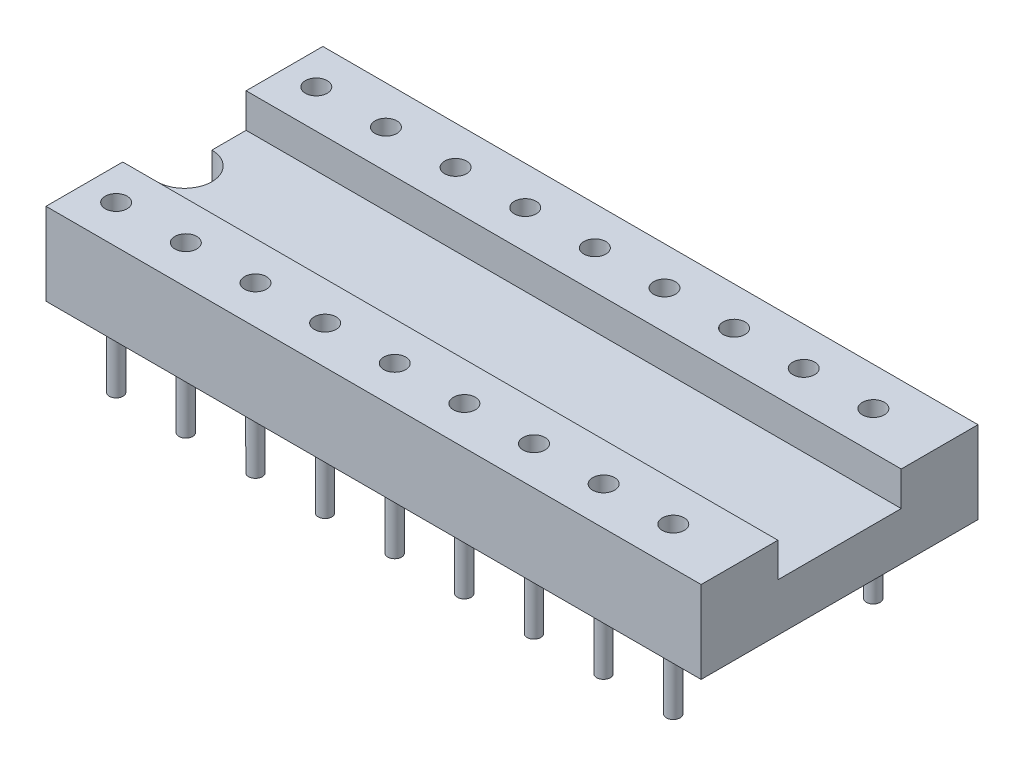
ISO-10303-21;
HEADER;
FILE_DESCRIPTION(('STEP AP214'),'2;1');
FILE_NAME('part.step','',(''),(''),'','','');
FILE_SCHEMA(('AUTOMOTIVE_DESIGN { 1 0 10303 214 1 1 1 1 }'));
ENDSEC;
DATA;
#1=APPLICATION_CONTEXT('core data for automotive mechanical design processes');
#2=APPLICATION_PROTOCOL_DEFINITION('international standard','automotive_design',2000,#1);
#3=PRODUCT_CONTEXT('',#1,'mechanical');
#4=PRODUCT('Part','Part','',(#3));
#5=PRODUCT_RELATED_PRODUCT_CATEGORY('part','',(#4));
#6=PRODUCT_DEFINITION_FORMATION('','',#4);
#7=PRODUCT_DEFINITION_CONTEXT('part definition',#1,'design');
#8=PRODUCT_DEFINITION('design','',#6,#7);
#9=PRODUCT_DEFINITION_SHAPE('','',#8);
#10=(LENGTH_UNIT() NAMED_UNIT(*) SI_UNIT(.MILLI.,.METRE.));
#11=(NAMED_UNIT(*) PLANE_ANGLE_UNIT() SI_UNIT($,.RADIAN.));
#12=(NAMED_UNIT(*) SI_UNIT($,.STERADIAN.) SOLID_ANGLE_UNIT());
#13=UNCERTAINTY_MEASURE_WITH_UNIT(LENGTH_MEASURE(1.E-05),#10,'distance_accuracy_value','');
#14=(GEOMETRIC_REPRESENTATION_CONTEXT(3) GLOBAL_UNCERTAINTY_ASSIGNED_CONTEXT((#13)) GLOBAL_UNIT_ASSIGNED_CONTEXT((#10,
#11,#12)) REPRESENTATION_CONTEXT('',''));
#15=CARTESIAN_POINT('',(0.,0.,0.));
#16=DIRECTION('',(0.,0.,1.));
#17=DIRECTION('',(1.,0.,0.));
#18=AXIS2_PLACEMENT_3D('',#15,#16,#17);
#19=CARTESIAN_POINT('',(23.9,0.,5.05));
#20=DIRECTION('',(0.,1.,0.));
#21=DIRECTION('',(0.,0.,1.));
#22=AXIS2_PLACEMENT_3D('',#19,#20,#21);
#23=PLANE('',#22);
#24=CARTESIAN_POINT('',(21.48,0.,3.65));
#25=DIRECTION('',(0.,1.,0.));
#26=DIRECTION('',(0.,0.,1.));
#27=AXIS2_PLACEMENT_3D('',#24,#25,#26);
#28=CIRCLE('',#27,0.25);
#29=CARTESIAN_POINT('',(21.48,0.,3.9));
#30=VERTEX_POINT('',#29);
#31=EDGE_CURVE('E39',#30,#30,#28,.F.);
#32=ORIENTED_EDGE('',*,*,#31,.F.);
#33=EDGE_LOOP('',(#32));
#34=FACE_BOUND('',#33,.T.);
#35=CARTESIAN_POINT('',(18.94,0.,3.65));
#36=DIRECTION('',(0.,1.,0.));
#37=DIRECTION('',(0.,0.,1.));
#38=AXIS2_PLACEMENT_3D('',#35,#36,#37);
#39=CIRCLE('',#38,0.25);
#40=CARTESIAN_POINT('',(18.94,0.,3.9));
#41=VERTEX_POINT('',#40);
#42=EDGE_CURVE('E227',#41,#41,#39,.F.);
#43=ORIENTED_EDGE('',*,*,#42,.F.);
#44=EDGE_LOOP('',(#43));
#45=FACE_BOUND('',#44,.T.);
#46=CARTESIAN_POINT('',(16.4,0.,3.65));
#47=DIRECTION('',(0.,1.,0.));
#48=DIRECTION('',(0.,0.,1.));
#49=AXIS2_PLACEMENT_3D('',#46,#47,#48);
#50=CIRCLE('',#49,0.25);
#51=CARTESIAN_POINT('',(16.4,0.,3.9));
#52=VERTEX_POINT('',#51);
#53=EDGE_CURVE('E221',#52,#52,#50,.F.);
#54=ORIENTED_EDGE('',*,*,#53,.F.);
#55=EDGE_LOOP('',(#54));
#56=FACE_BOUND('',#55,.T.);
#57=CARTESIAN_POINT('',(13.86,0.,3.65));
#58=DIRECTION('',(0.,1.,0.));
#59=DIRECTION('',(0.,0.,1.));
#60=AXIS2_PLACEMENT_3D('',#57,#58,#59);
#61=CIRCLE('',#60,0.25);
#62=CARTESIAN_POINT('',(13.86,0.,3.9));
#63=VERTEX_POINT('',#62);
#64=EDGE_CURVE('E215',#63,#63,#61,.F.);
#65=ORIENTED_EDGE('',*,*,#64,.F.);
#66=EDGE_LOOP('',(#65));
#67=FACE_BOUND('',#66,.T.);
#68=CARTESIAN_POINT('',(11.32,0.,3.65));
#69=DIRECTION('',(0.,1.,0.));
#70=DIRECTION('',(0.,0.,1.));
#71=AXIS2_PLACEMENT_3D('',#68,#69,#70);
#72=CIRCLE('',#71,0.25);
#73=CARTESIAN_POINT('',(11.32,0.,3.9));
#74=VERTEX_POINT('',#73);
#75=EDGE_CURVE('E209',#74,#74,#72,.F.);
#76=ORIENTED_EDGE('',*,*,#75,.F.);
#77=EDGE_LOOP('',(#76));
#78=FACE_BOUND('',#77,.T.);
#79=CARTESIAN_POINT('',(8.78,0.,3.65));
#80=DIRECTION('',(0.,1.,0.));
#81=DIRECTION('',(0.,0.,1.));
#82=AXIS2_PLACEMENT_3D('',#79,#80,#81);
#83=CIRCLE('',#82,0.25);
#84=CARTESIAN_POINT('',(8.78,0.,3.9));
#85=VERTEX_POINT('',#84);
#86=EDGE_CURVE('E203',#85,#85,#83,.F.);
#87=ORIENTED_EDGE('',*,*,#86,.F.);
#88=EDGE_LOOP('',(#87));
#89=FACE_BOUND('',#88,.T.);
#90=CARTESIAN_POINT('',(6.24,0.,3.65));
#91=DIRECTION('',(0.,1.,0.));
#92=DIRECTION('',(0.,0.,1.));
#93=AXIS2_PLACEMENT_3D('',#90,#91,#92);
#94=CIRCLE('',#93,0.25);
#95=CARTESIAN_POINT('',(6.24,0.,3.9));
#96=VERTEX_POINT('',#95);
#97=EDGE_CURVE('E197',#96,#96,#94,.F.);
#98=ORIENTED_EDGE('',*,*,#97,.F.);
#99=EDGE_LOOP('',(#98));
#100=FACE_BOUND('',#99,.T.);
#101=CARTESIAN_POINT('',(3.7,0.,3.65));
#102=DIRECTION('',(0.,1.,0.));
#103=DIRECTION('',(0.,0.,1.));
#104=AXIS2_PLACEMENT_3D('',#101,#102,#103);
#105=CIRCLE('',#104,0.25);
#106=CARTESIAN_POINT('',(3.7,0.,3.9));
#107=VERTEX_POINT('',#106);
#108=EDGE_CURVE('E191',#107,#107,#105,.F.);
#109=ORIENTED_EDGE('',*,*,#108,.F.);
#110=EDGE_LOOP('',(#109));
#111=FACE_BOUND('',#110,.T.);
#112=CARTESIAN_POINT('',(1.16,0.,3.65));
#113=DIRECTION('',(0.,1.,0.));
#114=DIRECTION('',(0.,0.,1.));
#115=AXIS2_PLACEMENT_3D('',#112,#113,#114);
#116=CIRCLE('',#115,0.25);
#117=CARTESIAN_POINT('',(1.16,0.,3.9));
#118=VERTEX_POINT('',#117);
#119=EDGE_CURVE('E185',#118,#118,#116,.F.);
#120=ORIENTED_EDGE('',*,*,#119,.F.);
#121=EDGE_LOOP('',(#120));
#122=FACE_BOUND('',#121,.T.);
#123=DIRECTION('',(0.,0.,-1.));
#124=VECTOR('',#123,1.);
#125=CARTESIAN_POINT('',(0.,0.,5.05));
#126=LINE('',#125,#124);
#127=CARTESIAN_POINT('',(0.,0.,5.05));
#128=VERTEX_POINT('',#127);
#129=CARTESIAN_POINT('',(0.,0.,1.));
#130=VERTEX_POINT('',#129);
#131=EDGE_CURVE('E139',#128,#130,#126,.T.);
#132=ORIENTED_EDGE('',*,*,#131,.T.);
#133=CARTESIAN_POINT('',(0.,0.,0.));
#134=DIRECTION('',(0.,1.,0.));
#135=DIRECTION('',(0.,0.,1.));
#136=AXIS2_PLACEMENT_3D('',#133,#134,#135);
#137=CIRCLE('',#136,1.);
#138=CARTESIAN_POINT('',(0.,0.,-1.));
#139=VERTEX_POINT('',#138);
#140=EDGE_CURVE('E46',#130,#139,#137,.T.);
#141=ORIENTED_EDGE('',*,*,#140,.T.);
#142=CARTESIAN_POINT('',(0.,0.,-5.05));
#143=VERTEX_POINT('',#142);
#144=EDGE_CURVE('E124',#139,#143,#126,.T.);
#145=ORIENTED_EDGE('',*,*,#144,.T.);
#146=DIRECTION('',(-1.,0.,0.));
#147=VECTOR('',#146,1.);
#148=CARTESIAN_POINT('',(23.9,0.,-5.05));
#149=LINE('',#148,#147);
#150=CARTESIAN_POINT('',(23.9,0.,-5.05));
#151=VERTEX_POINT('',#150);
#152=EDGE_CURVE('E170',#151,#143,#149,.T.);
#153=ORIENTED_EDGE('',*,*,#152,.F.);
#154=DIRECTION('',(0.,0.,-1.));
#155=VECTOR('',#154,1.);
#156=CARTESIAN_POINT('',(23.9,0.,5.05));
#157=LINE('',#156,#155);
#158=CARTESIAN_POINT('',(23.9,0.,5.05));
#159=VERTEX_POINT('',#158);
#160=EDGE_CURVE('E156',#159,#151,#157,.T.);
#161=ORIENTED_EDGE('',*,*,#160,.F.);
#162=DIRECTION('',(-1.,0.,0.));
#163=VECTOR('',#162,1.);
#164=CARTESIAN_POINT('',(23.9,0.,5.05));
#165=LINE('',#164,#163);
#166=EDGE_CURVE('E173',#159,#128,#165,.T.);
#167=ORIENTED_EDGE('',*,*,#166,.T.);
#168=EDGE_LOOP('',(#132,#141,#145,#153,#161,#167));
#169=FACE_BOUND('',#168,.T.);
#170=CARTESIAN_POINT('',(1.16,0.,-3.65));
#171=DIRECTION('',(0.,1.,0.));
#172=DIRECTION('',(0.,0.,1.));
#173=AXIS2_PLACEMENT_3D('',#170,#171,#172);
#174=CIRCLE('',#173,0.25);
#175=CARTESIAN_POINT('',(1.16,0.,-3.4));
#176=VERTEX_POINT('',#175);
#177=EDGE_CURVE('E188',#176,#176,#174,.F.);
#178=ORIENTED_EDGE('',*,*,#177,.F.);
#179=EDGE_LOOP('',(#178));
#180=FACE_BOUND('',#179,.T.);
#181=CARTESIAN_POINT('',(3.7,0.,-3.65));
#182=DIRECTION('',(0.,1.,0.));
#183=DIRECTION('',(0.,0.,1.));
#184=AXIS2_PLACEMENT_3D('',#181,#182,#183);
#185=CIRCLE('',#184,0.25);
#186=CARTESIAN_POINT('',(3.7,0.,-3.4));
#187=VERTEX_POINT('',#186);
#188=EDGE_CURVE('E194',#187,#187,#185,.F.);
#189=ORIENTED_EDGE('',*,*,#188,.F.);
#190=EDGE_LOOP('',(#189));
#191=FACE_BOUND('',#190,.T.);
#192=CARTESIAN_POINT('',(6.24,0.,-3.65));
#193=DIRECTION('',(0.,1.,0.));
#194=DIRECTION('',(0.,0.,1.));
#195=AXIS2_PLACEMENT_3D('',#192,#193,#194);
#196=CIRCLE('',#195,0.25);
#197=CARTESIAN_POINT('',(6.24,0.,-3.4));
#198=VERTEX_POINT('',#197);
#199=EDGE_CURVE('E200',#198,#198,#196,.F.);
#200=ORIENTED_EDGE('',*,*,#199,.F.);
#201=EDGE_LOOP('',(#200));
#202=FACE_BOUND('',#201,.T.);
#203=CARTESIAN_POINT('',(8.78,0.,-3.65));
#204=DIRECTION('',(0.,1.,0.));
#205=DIRECTION('',(0.,0.,1.));
#206=AXIS2_PLACEMENT_3D('',#203,#204,#205);
#207=CIRCLE('',#206,0.25);
#208=CARTESIAN_POINT('',(8.78,0.,-3.4));
#209=VERTEX_POINT('',#208);
#210=EDGE_CURVE('E206',#209,#209,#207,.F.);
#211=ORIENTED_EDGE('',*,*,#210,.F.);
#212=EDGE_LOOP('',(#211));
#213=FACE_BOUND('',#212,.T.);
#214=CARTESIAN_POINT('',(11.32,0.,-3.65));
#215=DIRECTION('',(0.,1.,0.));
#216=DIRECTION('',(0.,0.,1.));
#217=AXIS2_PLACEMENT_3D('',#214,#215,#216);
#218=CIRCLE('',#217,0.25);
#219=CARTESIAN_POINT('',(11.32,0.,-3.4));
#220=VERTEX_POINT('',#219);
#221=EDGE_CURVE('E212',#220,#220,#218,.F.);
#222=ORIENTED_EDGE('',*,*,#221,.F.);
#223=EDGE_LOOP('',(#222));
#224=FACE_BOUND('',#223,.T.);
#225=CARTESIAN_POINT('',(13.86,0.,-3.65));
#226=DIRECTION('',(0.,1.,0.));
#227=DIRECTION('',(0.,0.,1.));
#228=AXIS2_PLACEMENT_3D('',#225,#226,#227);
#229=CIRCLE('',#228,0.25);
#230=CARTESIAN_POINT('',(13.86,0.,-3.4));
#231=VERTEX_POINT('',#230);
#232=EDGE_CURVE('E218',#231,#231,#229,.F.);
#233=ORIENTED_EDGE('',*,*,#232,.F.);
#234=EDGE_LOOP('',(#233));
#235=FACE_BOUND('',#234,.T.);
#236=CARTESIAN_POINT('',(16.4,0.,-3.65));
#237=DIRECTION('',(0.,1.,0.));
#238=DIRECTION('',(0.,0.,1.));
#239=AXIS2_PLACEMENT_3D('',#236,#237,#238);
#240=CIRCLE('',#239,0.25);
#241=CARTESIAN_POINT('',(16.4,0.,-3.4));
#242=VERTEX_POINT('',#241);
#243=EDGE_CURVE('E224',#242,#242,#240,.F.);
#244=ORIENTED_EDGE('',*,*,#243,.F.);
#245=EDGE_LOOP('',(#244));
#246=FACE_BOUND('',#245,.T.);
#247=CARTESIAN_POINT('',(18.94,0.,-3.65));
#248=DIRECTION('',(0.,1.,0.));
#249=DIRECTION('',(0.,0.,1.));
#250=AXIS2_PLACEMENT_3D('',#247,#248,#249);
#251=CIRCLE('',#250,0.25);
#252=CARTESIAN_POINT('',(18.94,0.,-3.4));
#253=VERTEX_POINT('',#252);
#254=EDGE_CURVE('E230',#253,#253,#251,.F.);
#255=ORIENTED_EDGE('',*,*,#254,.F.);
#256=EDGE_LOOP('',(#255));
#257=FACE_BOUND('',#256,.T.);
#258=CARTESIAN_POINT('',(21.48,0.,-3.65));
#259=DIRECTION('',(0.,1.,0.));
#260=DIRECTION('',(0.,0.,1.));
#261=AXIS2_PLACEMENT_3D('',#258,#259,#260);
#262=CIRCLE('',#261,0.25);
#263=CARTESIAN_POINT('',(21.48,0.,-3.4));
#264=VERTEX_POINT('',#263);
#265=EDGE_CURVE('E11',#264,#264,#262,.F.);
#266=ORIENTED_EDGE('',*,*,#265,.F.);
#267=EDGE_LOOP('',(#266));
#268=FACE_BOUND('',#267,.T.);
#269=ADVANCED_FACE('F31',(#34,#45,#56,#67,#78,#89,#100,#111,#122,#169,#180,#191,#202,#213,#224,
#235,#246,#257,#268),#23,.F.);
#270=CARTESIAN_POINT('',(0.,1.75,5.05));
#271=DIRECTION('',(1.,0.,0.));
#272=DIRECTION('',(0.,0.,-1.));
#273=AXIS2_PLACEMENT_3D('',#270,#271,#272);
#274=PLANE('',#273);
#275=ORIENTED_EDGE('',*,*,#144,.F.);
#276=DIRECTION('',(0.,1.,0.));
#277=VECTOR('',#276,1.);
#278=CARTESIAN_POINT('',(0.,0.,-1.));
#279=LINE('',#278,#277);
#280=CARTESIAN_POINT('',(0.,1.75,-1.));
#281=VERTEX_POINT('',#280);
#282=EDGE_CURVE('E110',#139,#281,#279,.T.);
#283=ORIENTED_EDGE('',*,*,#282,.T.);
#284=DIRECTION('',(0.,0.,1.));
#285=VECTOR('',#284,1.);
#286=CARTESIAN_POINT('',(0.,1.75,-2.25));
#287=LINE('',#286,#285);
#288=CARTESIAN_POINT('',(0.,1.75,-2.25));
#289=VERTEX_POINT('',#288);
#290=EDGE_CURVE('E122',#289,#281,#287,.T.);
#291=ORIENTED_EDGE('',*,*,#290,.F.);
#292=DIRECTION('',(0.,-1.,0.));
#293=VECTOR('',#292,1.);
#294=CARTESIAN_POINT('',(0.,3.,-2.25));
#295=LINE('',#294,#293);
#296=CARTESIAN_POINT('',(0.,3.,-2.25));
#297=VERTEX_POINT('',#296);
#298=EDGE_CURVE('E146',#297,#289,#295,.T.);
#299=ORIENTED_EDGE('',*,*,#298,.F.);
#300=DIRECTION('',(0.,0.,1.));
#301=VECTOR('',#300,1.);
#302=CARTESIAN_POINT('',(0.,3.,-5.05));
#303=LINE('',#302,#301);
#304=CARTESIAN_POINT('',(0.,3.,-5.05));
#305=VERTEX_POINT('',#304);
#306=EDGE_CURVE('E144',#305,#297,#303,.T.);
#307=ORIENTED_EDGE('',*,*,#306,.F.);
#308=DIRECTION('',(0.,1.,0.));
#309=VECTOR('',#308,1.);
#310=CARTESIAN_POINT('',(0.,0.,-5.05));
#311=LINE('',#310,#309);
#312=EDGE_CURVE('E142',#143,#305,#311,.T.);
#313=ORIENTED_EDGE('',*,*,#312,.F.);
#314=EDGE_LOOP('',(#275,#283,#291,#299,#307,#313));
#315=FACE_BOUND('',#314,.T.);
#316=ADVANCED_FACE('F120',(#315),#274,.F.);
#317=CARTESIAN_POINT('',(23.9,1.75,-2.25));
#318=DIRECTION('',(0.,-1.,0.));
#319=DIRECTION('',(0.,0.,-1.));
#320=AXIS2_PLACEMENT_3D('',#317,#318,#319);
#321=PLANE('',#320);
#322=ORIENTED_EDGE('',*,*,#290,.T.);
#323=CARTESIAN_POINT('',(0.,1.75,0.));
#324=DIRECTION('',(0.,1.,0.));
#325=DIRECTION('',(0.,0.,1.));
#326=AXIS2_PLACEMENT_3D('',#323,#324,#325);
#327=CIRCLE('',#326,1.);
#328=CARTESIAN_POINT('',(0.,1.75,1.));
#329=VERTEX_POINT('',#328);
#330=EDGE_CURVE('E107',#329,#281,#327,.T.);
#331=ORIENTED_EDGE('',*,*,#330,.F.);
#332=CARTESIAN_POINT('',(0.,1.75,2.25));
#333=VERTEX_POINT('',#332);
#334=EDGE_CURVE('E130',#329,#333,#287,.T.);
#335=ORIENTED_EDGE('',*,*,#334,.T.);
#336=DIRECTION('',(-1.,0.,0.));
#337=VECTOR('',#336,1.);
#338=CARTESIAN_POINT('',(23.9,1.75,2.25));
#339=LINE('',#338,#337);
#340=CARTESIAN_POINT('',(23.9,1.75,2.25));
#341=VERTEX_POINT('',#340);
#342=EDGE_CURVE('E182',#341,#333,#339,.T.);
#343=ORIENTED_EDGE('',*,*,#342,.F.);
#344=DIRECTION('',(0.,0.,1.));
#345=VECTOR('',#344,1.);
#346=CARTESIAN_POINT('',(23.9,1.75,-2.25));
#347=LINE('',#346,#345);
#348=CARTESIAN_POINT('',(23.9,1.75,-2.25));
#349=VERTEX_POINT('',#348);
#350=EDGE_CURVE('E148',#349,#341,#347,.T.);
#351=ORIENTED_EDGE('',*,*,#350,.F.);
#352=DIRECTION('',(-1.,0.,0.));
#353=VECTOR('',#352,1.);
#354=CARTESIAN_POINT('',(23.9,1.75,-2.25));
#355=LINE('',#354,#353);
#356=EDGE_CURVE('E128',#349,#289,#355,.T.);
#357=ORIENTED_EDGE('',*,*,#356,.T.);
#358=EDGE_LOOP('',(#322,#331,#335,#343,#351,#357));
#359=FACE_BOUND('',#358,.T.);
#360=ADVANCED_FACE('F33',(#359),#321,.F.);
#361=CARTESIAN_POINT('',(23.9,1.75,2.25));
#362=DIRECTION('',(0.,0.,1.));
#363=DIRECTION('',(0.,-1.,0.));
#364=AXIS2_PLACEMENT_3D('',#361,#362,#363);
#365=PLANE('',#364);
#366=DIRECTION('',(0.,1.,0.));
#367=VECTOR('',#366,1.);
#368=CARTESIAN_POINT('',(0.,1.75,2.25));
#369=LINE('',#368,#367);
#370=CARTESIAN_POINT('',(0.,3.,2.25));
#371=VERTEX_POINT('',#370);
#372=EDGE_CURVE('E129',#333,#371,#369,.T.);
#373=ORIENTED_EDGE('',*,*,#372,.T.);
#374=DIRECTION('',(-1.,0.,0.));
#375=VECTOR('',#374,1.);
#376=CARTESIAN_POINT('',(23.9,3.,2.25));
#377=LINE('',#376,#375);
#378=CARTESIAN_POINT('',(23.9,3.,2.25));
#379=VERTEX_POINT('',#378);
#380=EDGE_CURVE('E179',#379,#371,#377,.T.);
#381=ORIENTED_EDGE('',*,*,#380,.F.);
#382=DIRECTION('',(0.,1.,0.));
#383=VECTOR('',#382,1.);
#384=CARTESIAN_POINT('',(23.9,1.75,2.25));
#385=LINE('',#384,#383);
#386=EDGE_CURVE('E150',#341,#379,#385,.T.);
#387=ORIENTED_EDGE('',*,*,#386,.F.);
#388=ORIENTED_EDGE('',*,*,#342,.T.);
#389=EDGE_LOOP('',(#373,#381,#387,#388));
#390=FACE_BOUND('',#389,.T.);
#391=ADVANCED_FACE('F594',(#390),#365,.F.);
#392=CARTESIAN_POINT('',(23.9,3.,2.25));
#393=DIRECTION('',(0.,-1.,0.));
#394=DIRECTION('',(0.,0.,-1.));
#395=AXIS2_PLACEMENT_3D('',#392,#393,#394);
#396=PLANE('',#395);
#397=CARTESIAN_POINT('',(21.483,3.,3.64999999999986));
#398=DIRECTION('',(0.,1.,0.));
#399=DIRECTION('',(0.,0.,1.));
#400=AXIS2_PLACEMENT_3D('',#397,#398,#399);
#401=CIRCLE('',#400,0.400000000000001);
#402=CARTESIAN_POINT('',(21.483,3.,4.04999999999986));
#403=VERTEX_POINT('',#402);
#404=EDGE_CURVE('E715',#403,#403,#401,.T.);
#405=ORIENTED_EDGE('',*,*,#404,.F.);
#406=EDGE_LOOP('',(#405));
#407=FACE_BOUND('',#406,.T.);
#408=CARTESIAN_POINT('',(18.943,3.,3.64999999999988));
#409=DIRECTION('',(0.,1.,0.));
#410=DIRECTION('',(0.,0.,1.));
#411=AXIS2_PLACEMENT_3D('',#408,#409,#410);
#412=CIRCLE('',#411,0.400000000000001);
#413=CARTESIAN_POINT('',(18.943,3.,4.04999999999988));
#414=VERTEX_POINT('',#413);
#415=EDGE_CURVE('E703',#414,#414,#412,.T.);
#416=ORIENTED_EDGE('',*,*,#415,.F.);
#417=EDGE_LOOP('',(#416));
#418=FACE_BOUND('',#417,.T.);
#419=CARTESIAN_POINT('',(16.403,3.,3.64999999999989));
#420=DIRECTION('',(0.,1.,0.));
#421=DIRECTION('',(0.,0.,1.));
#422=AXIS2_PLACEMENT_3D('',#419,#420,#421);
#423=CIRCLE('',#422,0.400000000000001);
#424=CARTESIAN_POINT('',(16.403,3.,4.04999999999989));
#425=VERTEX_POINT('',#424);
#426=EDGE_CURVE('E691',#425,#425,#423,.T.);
#427=ORIENTED_EDGE('',*,*,#426,.F.);
#428=EDGE_LOOP('',(#427));
#429=FACE_BOUND('',#428,.T.);
#430=CARTESIAN_POINT('',(13.863,3.,3.64999999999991));
#431=DIRECTION('',(0.,1.,0.));
#432=DIRECTION('',(0.,0.,1.));
#433=AXIS2_PLACEMENT_3D('',#430,#431,#432);
#434=CIRCLE('',#433,0.400000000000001);
#435=CARTESIAN_POINT('',(13.863,3.,4.04999999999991));
#436=VERTEX_POINT('',#435);
#437=EDGE_CURVE('E679',#436,#436,#434,.T.);
#438=ORIENTED_EDGE('',*,*,#437,.F.);
#439=EDGE_LOOP('',(#438));
#440=FACE_BOUND('',#439,.T.);
#441=CARTESIAN_POINT('',(11.323,3.,3.64999999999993));
#442=DIRECTION('',(0.,1.,0.));
#443=DIRECTION('',(0.,0.,1.));
#444=AXIS2_PLACEMENT_3D('',#441,#442,#443);
#445=CIRCLE('',#444,0.399999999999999);
#446=CARTESIAN_POINT('',(11.323,3.,4.04999999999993));
#447=VERTEX_POINT('',#446);
#448=EDGE_CURVE('E667',#447,#447,#445,.T.);
#449=ORIENTED_EDGE('',*,*,#448,.F.);
#450=EDGE_LOOP('',(#449));
#451=FACE_BOUND('',#450,.T.);
#452=CARTESIAN_POINT('',(8.783,3.,3.64999999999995));
#453=DIRECTION('',(0.,1.,0.));
#454=DIRECTION('',(0.,0.,1.));
#455=AXIS2_PLACEMENT_3D('',#452,#453,#454);
#456=CIRCLE('',#455,0.399999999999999);
#457=CARTESIAN_POINT('',(8.783,3.,4.04999999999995));
#458=VERTEX_POINT('',#457);
#459=EDGE_CURVE('E655',#458,#458,#456,.T.);
#460=ORIENTED_EDGE('',*,*,#459,.F.);
#461=EDGE_LOOP('',(#460));
#462=FACE_BOUND('',#461,.T.);
#463=CARTESIAN_POINT('',(6.242,3.,3.64999999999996));
#464=DIRECTION('',(0.,1.,0.));
#465=DIRECTION('',(0.,0.,1.));
#466=AXIS2_PLACEMENT_3D('',#463,#464,#465);
#467=CIRCLE('',#466,0.4);
#468=CARTESIAN_POINT('',(6.242,3.,4.04999999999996));
#469=VERTEX_POINT('',#468);
#470=EDGE_CURVE('E643',#469,#469,#467,.T.);
#471=ORIENTED_EDGE('',*,*,#470,.F.);
#472=EDGE_LOOP('',(#471));
#473=FACE_BOUND('',#472,.T.);
#474=CARTESIAN_POINT('',(3.701,3.,3.64999999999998));
#475=DIRECTION('',(0.,1.,0.));
#476=DIRECTION('',(0.,0.,1.));
#477=AXIS2_PLACEMENT_3D('',#474,#475,#476);
#478=CIRCLE('',#477,0.4);
#479=CARTESIAN_POINT('',(3.701,3.,4.04999999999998));
#480=VERTEX_POINT('',#479);
#481=EDGE_CURVE('E631',#480,#480,#478,.T.);
#482=ORIENTED_EDGE('',*,*,#481,.F.);
#483=EDGE_LOOP('',(#482));
#484=FACE_BOUND('',#483,.T.);
#485=CARTESIAN_POINT('',(1.16,3.,3.65));
#486=DIRECTION('',(0.,1.,0.));
#487=DIRECTION('',(0.,0.,1.));
#488=AXIS2_PLACEMENT_3D('',#485,#486,#487);
#489=CIRCLE('',#488,0.4);
#490=CARTESIAN_POINT('',(1.16,3.,4.05));
#491=VERTEX_POINT('',#490);
#492=EDGE_CURVE('E619',#491,#491,#489,.T.);
#493=ORIENTED_EDGE('',*,*,#492,.F.);
#494=EDGE_LOOP('',(#493));
#495=FACE_BOUND('',#494,.T.);
#496=DIRECTION('',(0.,0.,1.));
#497=VECTOR('',#496,1.);
#498=CARTESIAN_POINT('',(0.,3.,2.25));
#499=LINE('',#498,#497);
#500=CARTESIAN_POINT('',(0.,3.,5.05));
#501=VERTEX_POINT('',#500);
#502=EDGE_CURVE('E132',#371,#501,#499,.T.);
#503=ORIENTED_EDGE('',*,*,#502,.T.);
#504=DIRECTION('',(-1.,0.,0.));
#505=VECTOR('',#504,1.);
#506=CARTESIAN_POINT('',(23.9,3.,5.05));
#507=LINE('',#506,#505);
#508=CARTESIAN_POINT('',(23.9,3.,5.05));
#509=VERTEX_POINT('',#508);
#510=EDGE_CURVE('E176',#509,#501,#507,.T.);
#511=ORIENTED_EDGE('',*,*,#510,.F.);
#512=DIRECTION('',(0.,0.,1.));
#513=VECTOR('',#512,1.);
#514=CARTESIAN_POINT('',(23.9,3.,2.25));
#515=LINE('',#514,#513);
#516=EDGE_CURVE('E152',#379,#509,#515,.T.);
#517=ORIENTED_EDGE('',*,*,#516,.F.);
#518=ORIENTED_EDGE('',*,*,#380,.T.);
#519=EDGE_LOOP('',(#503,#511,#517,#518));
#520=FACE_BOUND('',#519,.T.);
#521=ADVANCED_FACE('F591',(#407,#418,#429,#440,#451,#462,#473,#484,#495,#520),#396,.F.);
#522=CARTESIAN_POINT('',(23.9,3.,5.05));
#523=DIRECTION('',(0.,0.,-1.));
#524=DIRECTION('',(-1.,0.,0.));
#525=AXIS2_PLACEMENT_3D('',#522,#523,#524);
#526=PLANE('',#525);
#527=DIRECTION('',(0.,-1.,0.));
#528=VECTOR('',#527,1.);
#529=CARTESIAN_POINT('',(0.,3.,5.05));
#530=LINE('',#529,#528);
#531=EDGE_CURVE('E137',#501,#128,#530,.T.);
#532=ORIENTED_EDGE('',*,*,#531,.T.);
#533=ORIENTED_EDGE('',*,*,#166,.F.);
#534=DIRECTION('',(0.,-1.,0.));
#535=VECTOR('',#534,1.);
#536=CARTESIAN_POINT('',(23.9,3.,5.05));
#537=LINE('',#536,#535);
#538=EDGE_CURVE('E154',#509,#159,#537,.T.);
#539=ORIENTED_EDGE('',*,*,#538,.F.);
#540=ORIENTED_EDGE('',*,*,#510,.T.);
#541=EDGE_LOOP('',(#532,#533,#539,#540));
#542=FACE_BOUND('',#541,.T.);
#543=ADVANCED_FACE('F586',(#542),#526,.F.);
#544=CARTESIAN_POINT('',(23.9,0.,-5.05));
#545=DIRECTION('',(0.,0.,1.));
#546=DIRECTION('',(0.,-1.,0.));
#547=AXIS2_PLACEMENT_3D('',#544,#545,#546);
#548=PLANE('',#547);
#549=ORIENTED_EDGE('',*,*,#312,.T.);
#550=DIRECTION('',(-1.,0.,0.));
#551=VECTOR('',#550,1.);
#552=CARTESIAN_POINT('',(23.9,3.,-5.05));
#553=LINE('',#552,#551);
#554=CARTESIAN_POINT('',(23.9,3.,-5.05));
#555=VERTEX_POINT('',#554);
#556=EDGE_CURVE('E167',#555,#305,#553,.T.);
#557=ORIENTED_EDGE('',*,*,#556,.F.);
#558=DIRECTION('',(0.,1.,0.));
#559=VECTOR('',#558,1.);
#560=CARTESIAN_POINT('',(23.9,0.,-5.05));
#561=LINE('',#560,#559);
#562=EDGE_CURVE('E158',#151,#555,#561,.T.);
#563=ORIENTED_EDGE('',*,*,#562,.F.);
#564=ORIENTED_EDGE('',*,*,#152,.T.);
#565=EDGE_LOOP('',(#549,#557,#563,#564));
#566=FACE_BOUND('',#565,.T.);
#567=ADVANCED_FACE('F583',(#566),#548,.F.);
#568=CARTESIAN_POINT('',(23.9,3.,-5.05));
#569=DIRECTION('',(0.,-1.,0.));
#570=DIRECTION('',(0.,0.,-1.));
#571=AXIS2_PLACEMENT_3D('',#568,#569,#570);
#572=PLANE('',#571);
#573=CARTESIAN_POINT('',(21.483,3.,-3.65000000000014));
#574=DIRECTION('',(0.,1.,0.));
#575=DIRECTION('',(0.,0.,-1.));
#576=AXIS2_PLACEMENT_3D('',#573,#574,#575);
#577=CIRCLE('',#576,0.400000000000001);
#578=CARTESIAN_POINT('',(21.483,3.,-4.05000000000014));
#579=VERTEX_POINT('',#578);
#580=EDGE_CURVE('E721',#579,#579,#577,.T.);
#581=ORIENTED_EDGE('',*,*,#580,.F.);
#582=EDGE_LOOP('',(#581));
#583=FACE_BOUND('',#582,.T.);
#584=CARTESIAN_POINT('',(18.943,3.,-3.65000000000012));
#585=DIRECTION('',(0.,1.,0.));
#586=DIRECTION('',(0.,0.,-1.));
#587=AXIS2_PLACEMENT_3D('',#584,#585,#586);
#588=CIRCLE('',#587,0.400000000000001);
#589=CARTESIAN_POINT('',(18.943,3.,-4.05000000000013));
#590=VERTEX_POINT('',#589);
#591=EDGE_CURVE('E709',#590,#590,#588,.T.);
#592=ORIENTED_EDGE('',*,*,#591,.F.);
#593=EDGE_LOOP('',(#592));
#594=FACE_BOUND('',#593,.T.);
#595=CARTESIAN_POINT('',(16.403,3.,-3.65000000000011));
#596=DIRECTION('',(0.,1.,0.));
#597=DIRECTION('',(0.,0.,-1.));
#598=AXIS2_PLACEMENT_3D('',#595,#596,#597);
#599=CIRCLE('',#598,0.400000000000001);
#600=CARTESIAN_POINT('',(16.403,3.,-4.05000000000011));
#601=VERTEX_POINT('',#600);
#602=EDGE_CURVE('E697',#601,#601,#599,.T.);
#603=ORIENTED_EDGE('',*,*,#602,.F.);
#604=EDGE_LOOP('',(#603));
#605=FACE_BOUND('',#604,.T.);
#606=CARTESIAN_POINT('',(13.863,3.,-3.65000000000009));
#607=DIRECTION('',(0.,1.,0.));
#608=DIRECTION('',(0.,0.,-1.));
#609=AXIS2_PLACEMENT_3D('',#606,#607,#608);
#610=CIRCLE('',#609,0.400000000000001);
#611=CARTESIAN_POINT('',(13.863,3.,-4.05000000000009));
#612=VERTEX_POINT('',#611);
#613=EDGE_CURVE('E685',#612,#612,#610,.T.);
#614=ORIENTED_EDGE('',*,*,#613,.F.);
#615=EDGE_LOOP('',(#614));
#616=FACE_BOUND('',#615,.T.);
#617=CARTESIAN_POINT('',(11.323,3.,-3.65000000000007));
#618=DIRECTION('',(0.,1.,0.));
#619=DIRECTION('',(0.,0.,-1.));
#620=AXIS2_PLACEMENT_3D('',#617,#618,#619);
#621=CIRCLE('',#620,0.399999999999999);
#622=CARTESIAN_POINT('',(11.323,3.,-4.05000000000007));
#623=VERTEX_POINT('',#622);
#624=EDGE_CURVE('E673',#623,#623,#621,.T.);
#625=ORIENTED_EDGE('',*,*,#624,.F.);
#626=EDGE_LOOP('',(#625));
#627=FACE_BOUND('',#626,.T.);
#628=CARTESIAN_POINT('',(8.783,3.,-3.65000000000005));
#629=DIRECTION('',(0.,1.,0.));
#630=DIRECTION('',(0.,0.,-1.));
#631=AXIS2_PLACEMENT_3D('',#628,#629,#630);
#632=CIRCLE('',#631,0.399999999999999);
#633=CARTESIAN_POINT('',(8.783,3.,-4.05000000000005));
#634=VERTEX_POINT('',#633);
#635=EDGE_CURVE('E661',#634,#634,#632,.T.);
#636=ORIENTED_EDGE('',*,*,#635,.F.);
#637=EDGE_LOOP('',(#636));
#638=FACE_BOUND('',#637,.T.);
#639=CARTESIAN_POINT('',(6.242,3.,-3.65000000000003));
#640=DIRECTION('',(0.,1.,0.));
#641=DIRECTION('',(0.,0.,-1.));
#642=AXIS2_PLACEMENT_3D('',#639,#640,#641);
#643=CIRCLE('',#642,0.4);
#644=CARTESIAN_POINT('',(6.242,3.,-4.05000000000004));
#645=VERTEX_POINT('',#644);
#646=EDGE_CURVE('E649',#645,#645,#643,.T.);
#647=ORIENTED_EDGE('',*,*,#646,.F.);
#648=EDGE_LOOP('',(#647));
#649=FACE_BOUND('',#648,.T.);
#650=CARTESIAN_POINT('',(3.701,3.,-3.65000000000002));
#651=DIRECTION('',(0.,1.,0.));
#652=DIRECTION('',(0.,0.,-1.));
#653=AXIS2_PLACEMENT_3D('',#650,#651,#652);
#654=CIRCLE('',#653,0.4);
#655=CARTESIAN_POINT('',(3.701,3.,-4.05000000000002));
#656=VERTEX_POINT('',#655);
#657=EDGE_CURVE('E637',#656,#656,#654,.T.);
#658=ORIENTED_EDGE('',*,*,#657,.F.);
#659=EDGE_LOOP('',(#658));
#660=FACE_BOUND('',#659,.T.);
#661=CARTESIAN_POINT('',(1.16,3.,-3.65));
#662=DIRECTION('',(0.,1.,0.));
#663=DIRECTION('',(0.,0.,-1.));
#664=AXIS2_PLACEMENT_3D('',#661,#662,#663);
#665=CIRCLE('',#664,0.4);
#666=CARTESIAN_POINT('',(1.16,3.,-4.05));
#667=VERTEX_POINT('',#666);
#668=EDGE_CURVE('E625',#667,#667,#665,.T.);
#669=ORIENTED_EDGE('',*,*,#668,.F.);
#670=EDGE_LOOP('',(#669));
#671=FACE_BOUND('',#670,.T.);
#672=ORIENTED_EDGE('',*,*,#306,.T.);
#673=DIRECTION('',(-1.,0.,0.));
#674=VECTOR('',#673,1.);
#675=CARTESIAN_POINT('',(23.9,3.,-2.25));
#676=LINE('',#675,#674);
#677=CARTESIAN_POINT('',(23.9,3.,-2.25));
#678=VERTEX_POINT('',#677);
#679=EDGE_CURVE('E164',#678,#297,#676,.T.);
#680=ORIENTED_EDGE('',*,*,#679,.F.);
#681=DIRECTION('',(0.,0.,1.));
#682=VECTOR('',#681,1.);
#683=CARTESIAN_POINT('',(23.9,3.,-5.05));
#684=LINE('',#683,#682);
#685=EDGE_CURVE('E160',#555,#678,#684,.T.);
#686=ORIENTED_EDGE('',*,*,#685,.F.);
#687=ORIENTED_EDGE('',*,*,#556,.T.);
#688=EDGE_LOOP('',(#672,#680,#686,#687));
#689=FACE_BOUND('',#688,.T.);
#690=ADVANCED_FACE('F579',(#583,#594,#605,#616,#627,#638,#649,#660,#671,#689),#572,.F.);
#691=CARTESIAN_POINT('',(23.9,3.,-2.25));
#692=DIRECTION('',(0.,0.,-1.));
#693=DIRECTION('',(0.,1.,0.));
#694=AXIS2_PLACEMENT_3D('',#691,#692,#693);
#695=PLANE('',#694);
#696=ORIENTED_EDGE('',*,*,#298,.T.);
#697=ORIENTED_EDGE('',*,*,#356,.F.);
#698=DIRECTION('',(0.,-1.,0.));
#699=VECTOR('',#698,1.);
#700=CARTESIAN_POINT('',(23.9,3.,-2.25));
#701=LINE('',#700,#699);
#702=EDGE_CURVE('E54',#678,#349,#701,.T.);
#703=ORIENTED_EDGE('',*,*,#702,.F.);
#704=ORIENTED_EDGE('',*,*,#679,.T.);
#705=EDGE_LOOP('',(#696,#697,#703,#704));
#706=FACE_BOUND('',#705,.T.);
#707=ADVANCED_FACE('F576',(#706),#695,.F.);
#708=CARTESIAN_POINT('',(23.9,1.75,5.05));
#709=DIRECTION('',(1.,0.,0.));
#710=DIRECTION('',(0.,0.,-1.));
#711=AXIS2_PLACEMENT_3D('',#708,#709,#710);
#712=PLANE('',#711);
#713=ORIENTED_EDGE('',*,*,#350,.T.);
#714=ORIENTED_EDGE('',*,*,#386,.T.);
#715=ORIENTED_EDGE('',*,*,#516,.T.);
#716=ORIENTED_EDGE('',*,*,#538,.T.);
#717=ORIENTED_EDGE('',*,*,#160,.T.);
#718=ORIENTED_EDGE('',*,*,#562,.T.);
#719=ORIENTED_EDGE('',*,*,#685,.T.);
#720=ORIENTED_EDGE('',*,*,#702,.T.);
#721=EDGE_LOOP('',(#713,#714,#715,#716,#717,#718,#719,#720));
#722=FACE_BOUND('',#721,.T.);
#723=ADVANCED_FACE('F572',(#722),#712,.T.);
#724=ORIENTED_EDGE('',*,*,#334,.F.);
#725=DIRECTION('',(0.,1.,0.));
#726=VECTOR('',#725,1.);
#727=CARTESIAN_POINT('',(0.,0.,1.));
#728=LINE('',#727,#726);
#729=EDGE_CURVE('E111',#130,#329,#728,.T.);
#730=ORIENTED_EDGE('',*,*,#729,.F.);
#731=ORIENTED_EDGE('',*,*,#131,.F.);
#732=ORIENTED_EDGE('',*,*,#531,.F.);
#733=ORIENTED_EDGE('',*,*,#502,.F.);
#734=ORIENTED_EDGE('',*,*,#372,.F.);
#735=EDGE_LOOP('',(#724,#730,#731,#732,#733,#734));
#736=FACE_BOUND('',#735,.T.);
#737=ADVANCED_FACE('F569',(#736),#274,.F.);
#738=CARTESIAN_POINT('',(0.,0.,0.));
#739=DIRECTION('',(0.,1.,0.));
#740=DIRECTION('',(0.,0.,1.));
#741=AXIS2_PLACEMENT_3D('',#738,#739,#740);
#742=CYLINDRICAL_SURFACE('',#741,1.);
#743=ORIENTED_EDGE('',*,*,#330,.T.);
#744=ORIENTED_EDGE('',*,*,#282,.F.);
#745=ORIENTED_EDGE('',*,*,#140,.F.);
#746=ORIENTED_EDGE('',*,*,#729,.T.);
#747=EDGE_LOOP('',(#743,#744,#745,#746));
#748=FACE_BOUND('',#747,.T.);
#749=ADVANCED_FACE('F109',(#748),#742,.F.);
#750=CARTESIAN_POINT('',(1.16,0.5,3.65));
#751=DIRECTION('',(0.,1.,0.));
#752=DIRECTION('',(0.,0.,1.));
#753=AXIS2_PLACEMENT_3D('',#750,#751,#752);
#754=CYLINDRICAL_SURFACE('',#753,0.4);
#755=CARTESIAN_POINT('',(1.16,0.5,3.65));
#756=DIRECTION('',(0.,1.,0.));
#757=DIRECTION('',(0.,0.,1.));
#758=AXIS2_PLACEMENT_3D('',#755,#756,#757);
#759=CIRCLE('',#758,0.4);
#760=CARTESIAN_POINT('',(1.16,0.5,4.05));
#761=VERTEX_POINT('',#760);
#762=EDGE_CURVE('E115',#761,#761,#759,.T.);
#763=ORIENTED_EDGE('',*,*,#762,.F.);
#764=EDGE_LOOP('',(#763));
#765=FACE_BOUND('',#764,.T.);
#766=ORIENTED_EDGE('',*,*,#492,.T.);
#767=EDGE_LOOP('',(#766));
#768=FACE_BOUND('',#767,.T.);
#769=ADVANCED_FACE('F562',(#765,#768),#754,.F.);
#770=CARTESIAN_POINT('',(1.16,0.5,3.65));
#771=DIRECTION('',(0.,1.,0.));
#772=DIRECTION('',(0.,0.,1.));
#773=AXIS2_PLACEMENT_3D('',#770,#771,#772);
#774=PLANE('',#773);
#775=ORIENTED_EDGE('',*,*,#762,.T.);
#776=EDGE_LOOP('',(#775));
#777=FACE_BOUND('',#776,.T.);
#778=ADVANCED_FACE('F558',(#777),#774,.T.);
#779=CARTESIAN_POINT('',(1.16,0.5,-3.65));
#780=DIRECTION('',(0.,1.,0.));
#781=DIRECTION('',(0.,0.,1.));
#782=AXIS2_PLACEMENT_3D('',#779,#780,#781);
#783=CYLINDRICAL_SURFACE('',#782,0.4);
#784=CARTESIAN_POINT('',(1.16,0.5,-3.65));
#785=DIRECTION('',(0.,1.,0.));
#786=DIRECTION('',(0.,0.,-1.));
#787=AXIS2_PLACEMENT_3D('',#784,#785,#786);
#788=CIRCLE('',#787,0.4);
#789=CARTESIAN_POINT('',(1.16,0.5,-4.05));
#790=VERTEX_POINT('',#789);
#791=EDGE_CURVE('E622',#790,#790,#788,.T.);
#792=ORIENTED_EDGE('',*,*,#791,.F.);
#793=EDGE_LOOP('',(#792));
#794=FACE_BOUND('',#793,.T.);
#795=ORIENTED_EDGE('',*,*,#668,.T.);
#796=EDGE_LOOP('',(#795));
#797=FACE_BOUND('',#796,.T.);
#798=ADVANCED_FACE('F554',(#794,#797),#783,.F.);
#799=CARTESIAN_POINT('',(1.16,0.5,-3.65));
#800=DIRECTION('',(0.,-1.,0.));
#801=DIRECTION('',(0.,0.,-1.));
#802=AXIS2_PLACEMENT_3D('',#799,#800,#801);
#803=PLANE('',#802);
#804=ORIENTED_EDGE('',*,*,#791,.T.);
#805=EDGE_LOOP('',(#804));
#806=FACE_BOUND('',#805,.T.);
#807=ADVANCED_FACE('F550',(#806),#803,.F.);
#808=CARTESIAN_POINT('',(3.701,0.5,3.64999999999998));
#809=DIRECTION('',(0.,1.,0.));
#810=DIRECTION('',(0.,0.,1.));
#811=AXIS2_PLACEMENT_3D('',#808,#809,#810);
#812=CYLINDRICAL_SURFACE('',#811,0.4);
#813=CARTESIAN_POINT('',(3.701,0.5,3.64999999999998));
#814=DIRECTION('',(0.,1.,0.));
#815=DIRECTION('',(0.,0.,1.));
#816=AXIS2_PLACEMENT_3D('',#813,#814,#815);
#817=CIRCLE('',#816,0.4);
#818=CARTESIAN_POINT('',(3.701,0.5,4.04999999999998));
#819=VERTEX_POINT('',#818);
#820=EDGE_CURVE('E628',#819,#819,#817,.T.);
#821=ORIENTED_EDGE('',*,*,#820,.F.);
#822=EDGE_LOOP('',(#821));
#823=FACE_BOUND('',#822,.T.);
#824=ORIENTED_EDGE('',*,*,#481,.T.);
#825=EDGE_LOOP('',(#824));
#826=FACE_BOUND('',#825,.T.);
#827=ADVANCED_FACE('F546',(#823,#826),#812,.F.);
#828=CARTESIAN_POINT('',(3.701,0.5,3.64999999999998));
#829=DIRECTION('',(0.,1.,0.));
#830=DIRECTION('',(0.,0.,1.));
#831=AXIS2_PLACEMENT_3D('',#828,#829,#830);
#832=PLANE('',#831);
#833=ORIENTED_EDGE('',*,*,#820,.T.);
#834=EDGE_LOOP('',(#833));
#835=FACE_BOUND('',#834,.T.);
#836=ADVANCED_FACE('F542',(#835),#832,.T.);
#837=CARTESIAN_POINT('',(3.701,0.5,-3.65000000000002));
#838=DIRECTION('',(0.,1.,0.));
#839=DIRECTION('',(0.,0.,1.));
#840=AXIS2_PLACEMENT_3D('',#837,#838,#839);
#841=CYLINDRICAL_SURFACE('',#840,0.4);
#842=CARTESIAN_POINT('',(3.701,0.5,-3.65000000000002));
#843=DIRECTION('',(0.,1.,0.));
#844=DIRECTION('',(0.,0.,-1.));
#845=AXIS2_PLACEMENT_3D('',#842,#843,#844);
#846=CIRCLE('',#845,0.4);
#847=CARTESIAN_POINT('',(3.701,0.5,-4.05000000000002));
#848=VERTEX_POINT('',#847);
#849=EDGE_CURVE('E634',#848,#848,#846,.T.);
#850=ORIENTED_EDGE('',*,*,#849,.F.);
#851=EDGE_LOOP('',(#850));
#852=FACE_BOUND('',#851,.T.);
#853=ORIENTED_EDGE('',*,*,#657,.T.);
#854=EDGE_LOOP('',(#853));
#855=FACE_BOUND('',#854,.T.);
#856=ADVANCED_FACE('F538',(#852,#855),#841,.F.);
#857=CARTESIAN_POINT('',(3.701,0.5,-3.65000000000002));
#858=DIRECTION('',(0.,-1.,0.));
#859=DIRECTION('',(0.,0.,-1.));
#860=AXIS2_PLACEMENT_3D('',#857,#858,#859);
#861=PLANE('',#860);
#862=ORIENTED_EDGE('',*,*,#849,.T.);
#863=EDGE_LOOP('',(#862));
#864=FACE_BOUND('',#863,.T.);
#865=ADVANCED_FACE('F534',(#864),#861,.F.);
#866=CARTESIAN_POINT('',(6.242,0.5,3.64999999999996));
#867=DIRECTION('',(0.,1.,0.));
#868=DIRECTION('',(0.,0.,1.));
#869=AXIS2_PLACEMENT_3D('',#866,#867,#868);
#870=CYLINDRICAL_SURFACE('',#869,0.4);
#871=CARTESIAN_POINT('',(6.242,0.5,3.64999999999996));
#872=DIRECTION('',(0.,1.,0.));
#873=DIRECTION('',(0.,0.,1.));
#874=AXIS2_PLACEMENT_3D('',#871,#872,#873);
#875=CIRCLE('',#874,0.4);
#876=CARTESIAN_POINT('',(6.242,0.5,4.04999999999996));
#877=VERTEX_POINT('',#876);
#878=EDGE_CURVE('E640',#877,#877,#875,.T.);
#879=ORIENTED_EDGE('',*,*,#878,.F.);
#880=EDGE_LOOP('',(#879));
#881=FACE_BOUND('',#880,.T.);
#882=ORIENTED_EDGE('',*,*,#470,.T.);
#883=EDGE_LOOP('',(#882));
#884=FACE_BOUND('',#883,.T.);
#885=ADVANCED_FACE('F530',(#881,#884),#870,.F.);
#886=CARTESIAN_POINT('',(6.242,0.5,3.64999999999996));
#887=DIRECTION('',(0.,1.,0.));
#888=DIRECTION('',(0.,0.,1.));
#889=AXIS2_PLACEMENT_3D('',#886,#887,#888);
#890=PLANE('',#889);
#891=ORIENTED_EDGE('',*,*,#878,.T.);
#892=EDGE_LOOP('',(#891));
#893=FACE_BOUND('',#892,.T.);
#894=ADVANCED_FACE('F526',(#893),#890,.T.);
#895=CARTESIAN_POINT('',(6.242,0.5,-3.65000000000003));
#896=DIRECTION('',(0.,1.,0.));
#897=DIRECTION('',(0.,0.,1.));
#898=AXIS2_PLACEMENT_3D('',#895,#896,#897);
#899=CYLINDRICAL_SURFACE('',#898,0.4);
#900=CARTESIAN_POINT('',(6.242,0.5,-3.65000000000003));
#901=DIRECTION('',(0.,1.,0.));
#902=DIRECTION('',(0.,0.,-1.));
#903=AXIS2_PLACEMENT_3D('',#900,#901,#902);
#904=CIRCLE('',#903,0.4);
#905=CARTESIAN_POINT('',(6.242,0.5,-4.05000000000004));
#906=VERTEX_POINT('',#905);
#907=EDGE_CURVE('E646',#906,#906,#904,.T.);
#908=ORIENTED_EDGE('',*,*,#907,.F.);
#909=EDGE_LOOP('',(#908));
#910=FACE_BOUND('',#909,.T.);
#911=ORIENTED_EDGE('',*,*,#646,.T.);
#912=EDGE_LOOP('',(#911));
#913=FACE_BOUND('',#912,.T.);
#914=ADVANCED_FACE('F522',(#910,#913),#899,.F.);
#915=CARTESIAN_POINT('',(6.242,0.5,-3.65000000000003));
#916=DIRECTION('',(0.,-1.,0.));
#917=DIRECTION('',(0.,0.,-1.));
#918=AXIS2_PLACEMENT_3D('',#915,#916,#917);
#919=PLANE('',#918);
#920=ORIENTED_EDGE('',*,*,#907,.T.);
#921=EDGE_LOOP('',(#920));
#922=FACE_BOUND('',#921,.T.);
#923=ADVANCED_FACE('F518',(#922),#919,.F.);
#924=CARTESIAN_POINT('',(8.783,0.5,3.64999999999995));
#925=DIRECTION('',(0.,1.,0.));
#926=DIRECTION('',(0.,0.,1.));
#927=AXIS2_PLACEMENT_3D('',#924,#925,#926);
#928=CYLINDRICAL_SURFACE('',#927,0.399999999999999);
#929=CARTESIAN_POINT('',(8.783,0.5,3.64999999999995));
#930=DIRECTION('',(0.,1.,0.));
#931=DIRECTION('',(0.,0.,1.));
#932=AXIS2_PLACEMENT_3D('',#929,#930,#931);
#933=CIRCLE('',#932,0.399999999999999);
#934=CARTESIAN_POINT('',(8.783,0.5,4.04999999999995));
#935=VERTEX_POINT('',#934);
#936=EDGE_CURVE('E652',#935,#935,#933,.T.);
#937=ORIENTED_EDGE('',*,*,#936,.F.);
#938=EDGE_LOOP('',(#937));
#939=FACE_BOUND('',#938,.T.);
#940=ORIENTED_EDGE('',*,*,#459,.T.);
#941=EDGE_LOOP('',(#940));
#942=FACE_BOUND('',#941,.T.);
#943=ADVANCED_FACE('F514',(#939,#942),#928,.F.);
#944=CARTESIAN_POINT('',(8.783,0.5,3.64999999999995));
#945=DIRECTION('',(0.,1.,0.));
#946=DIRECTION('',(0.,0.,1.));
#947=AXIS2_PLACEMENT_3D('',#944,#945,#946);
#948=PLANE('',#947);
#949=ORIENTED_EDGE('',*,*,#936,.T.);
#950=EDGE_LOOP('',(#949));
#951=FACE_BOUND('',#950,.T.);
#952=ADVANCED_FACE('F510',(#951),#948,.T.);
#953=CARTESIAN_POINT('',(8.783,0.5,-3.65000000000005));
#954=DIRECTION('',(0.,1.,0.));
#955=DIRECTION('',(0.,0.,1.));
#956=AXIS2_PLACEMENT_3D('',#953,#954,#955);
#957=CYLINDRICAL_SURFACE('',#956,0.399999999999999);
#958=CARTESIAN_POINT('',(8.783,0.5,-3.65000000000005));
#959=DIRECTION('',(0.,1.,0.));
#960=DIRECTION('',(0.,0.,-1.));
#961=AXIS2_PLACEMENT_3D('',#958,#959,#960);
#962=CIRCLE('',#961,0.399999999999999);
#963=CARTESIAN_POINT('',(8.783,0.5,-4.05000000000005));
#964=VERTEX_POINT('',#963);
#965=EDGE_CURVE('E658',#964,#964,#962,.T.);
#966=ORIENTED_EDGE('',*,*,#965,.F.);
#967=EDGE_LOOP('',(#966));
#968=FACE_BOUND('',#967,.T.);
#969=ORIENTED_EDGE('',*,*,#635,.T.);
#970=EDGE_LOOP('',(#969));
#971=FACE_BOUND('',#970,.T.);
#972=ADVANCED_FACE('F506',(#968,#971),#957,.F.);
#973=CARTESIAN_POINT('',(8.783,0.5,-3.65000000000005));
#974=DIRECTION('',(0.,-1.,0.));
#975=DIRECTION('',(0.,0.,-1.));
#976=AXIS2_PLACEMENT_3D('',#973,#974,#975);
#977=PLANE('',#976);
#978=ORIENTED_EDGE('',*,*,#965,.T.);
#979=EDGE_LOOP('',(#978));
#980=FACE_BOUND('',#979,.T.);
#981=ADVANCED_FACE('F502',(#980),#977,.F.);
#982=CARTESIAN_POINT('',(11.323,0.5,3.64999999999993));
#983=DIRECTION('',(0.,1.,0.));
#984=DIRECTION('',(0.,0.,1.));
#985=AXIS2_PLACEMENT_3D('',#982,#983,#984);
#986=CYLINDRICAL_SURFACE('',#985,0.399999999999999);
#987=CARTESIAN_POINT('',(11.323,0.5,3.64999999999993));
#988=DIRECTION('',(0.,1.,0.));
#989=DIRECTION('',(0.,0.,1.));
#990=AXIS2_PLACEMENT_3D('',#987,#988,#989);
#991=CIRCLE('',#990,0.399999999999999);
#992=CARTESIAN_POINT('',(11.323,0.5,4.04999999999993));
#993=VERTEX_POINT('',#992);
#994=EDGE_CURVE('E664',#993,#993,#991,.T.);
#995=ORIENTED_EDGE('',*,*,#994,.F.);
#996=EDGE_LOOP('',(#995));
#997=FACE_BOUND('',#996,.T.);
#998=ORIENTED_EDGE('',*,*,#448,.T.);
#999=EDGE_LOOP('',(#998));
#1000=FACE_BOUND('',#999,.T.);
#1001=ADVANCED_FACE('F498',(#997,#1000),#986,.F.);
#1002=CARTESIAN_POINT('',(11.323,0.5,3.64999999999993));
#1003=DIRECTION('',(0.,1.,0.));
#1004=DIRECTION('',(0.,0.,1.));
#1005=AXIS2_PLACEMENT_3D('',#1002,#1003,#1004);
#1006=PLANE('',#1005);
#1007=ORIENTED_EDGE('',*,*,#994,.T.);
#1008=EDGE_LOOP('',(#1007));
#1009=FACE_BOUND('',#1008,.T.);
#1010=ADVANCED_FACE('F494',(#1009),#1006,.T.);
#1011=CARTESIAN_POINT('',(11.323,0.5,-3.65000000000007));
#1012=DIRECTION('',(0.,1.,0.));
#1013=DIRECTION('',(0.,0.,1.));
#1014=AXIS2_PLACEMENT_3D('',#1011,#1012,#1013);
#1015=CYLINDRICAL_SURFACE('',#1014,0.399999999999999);
#1016=CARTESIAN_POINT('',(11.323,0.5,-3.65000000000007));
#1017=DIRECTION('',(0.,1.,0.));
#1018=DIRECTION('',(0.,0.,-1.));
#1019=AXIS2_PLACEMENT_3D('',#1016,#1017,#1018);
#1020=CIRCLE('',#1019,0.399999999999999);
#1021=CARTESIAN_POINT('',(11.323,0.5,-4.05000000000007));
#1022=VERTEX_POINT('',#1021);
#1023=EDGE_CURVE('E670',#1022,#1022,#1020,.T.);
#1024=ORIENTED_EDGE('',*,*,#1023,.F.);
#1025=EDGE_LOOP('',(#1024));
#1026=FACE_BOUND('',#1025,.T.);
#1027=ORIENTED_EDGE('',*,*,#624,.T.);
#1028=EDGE_LOOP('',(#1027));
#1029=FACE_BOUND('',#1028,.T.);
#1030=ADVANCED_FACE('F490',(#1026,#1029),#1015,.F.);
#1031=CARTESIAN_POINT('',(11.323,0.5,-3.65000000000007));
#1032=DIRECTION('',(0.,-1.,0.));
#1033=DIRECTION('',(0.,0.,-1.));
#1034=AXIS2_PLACEMENT_3D('',#1031,#1032,#1033);
#1035=PLANE('',#1034);
#1036=ORIENTED_EDGE('',*,*,#1023,.T.);
#1037=EDGE_LOOP('',(#1036));
#1038=FACE_BOUND('',#1037,.T.);
#1039=ADVANCED_FACE('F486',(#1038),#1035,.F.);
#1040=CARTESIAN_POINT('',(13.863,0.5,3.64999999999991));
#1041=DIRECTION('',(0.,1.,0.));
#1042=DIRECTION('',(0.,0.,1.));
#1043=AXIS2_PLACEMENT_3D('',#1040,#1041,#1042);
#1044=CYLINDRICAL_SURFACE('',#1043,0.400000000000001);
#1045=CARTESIAN_POINT('',(13.863,0.5,3.64999999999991));
#1046=DIRECTION('',(0.,1.,0.));
#1047=DIRECTION('',(0.,0.,1.));
#1048=AXIS2_PLACEMENT_3D('',#1045,#1046,#1047);
#1049=CIRCLE('',#1048,0.400000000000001);
#1050=CARTESIAN_POINT('',(13.863,0.5,4.04999999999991));
#1051=VERTEX_POINT('',#1050);
#1052=EDGE_CURVE('E676',#1051,#1051,#1049,.T.);
#1053=ORIENTED_EDGE('',*,*,#1052,.F.);
#1054=EDGE_LOOP('',(#1053));
#1055=FACE_BOUND('',#1054,.T.);
#1056=ORIENTED_EDGE('',*,*,#437,.T.);
#1057=EDGE_LOOP('',(#1056));
#1058=FACE_BOUND('',#1057,.T.);
#1059=ADVANCED_FACE('F482',(#1055,#1058),#1044,.F.);
#1060=CARTESIAN_POINT('',(13.863,0.5,3.64999999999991));
#1061=DIRECTION('',(0.,1.,0.));
#1062=DIRECTION('',(0.,0.,1.));
#1063=AXIS2_PLACEMENT_3D('',#1060,#1061,#1062);
#1064=PLANE('',#1063);
#1065=ORIENTED_EDGE('',*,*,#1052,.T.);
#1066=EDGE_LOOP('',(#1065));
#1067=FACE_BOUND('',#1066,.T.);
#1068=ADVANCED_FACE('F478',(#1067),#1064,.T.);
#1069=CARTESIAN_POINT('',(13.863,0.5,-3.65000000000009));
#1070=DIRECTION('',(0.,1.,0.));
#1071=DIRECTION('',(0.,0.,1.));
#1072=AXIS2_PLACEMENT_3D('',#1069,#1070,#1071);
#1073=CYLINDRICAL_SURFACE('',#1072,0.400000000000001);
#1074=CARTESIAN_POINT('',(13.863,0.5,-3.65000000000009));
#1075=DIRECTION('',(0.,1.,0.));
#1076=DIRECTION('',(0.,0.,-1.));
#1077=AXIS2_PLACEMENT_3D('',#1074,#1075,#1076);
#1078=CIRCLE('',#1077,0.400000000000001);
#1079=CARTESIAN_POINT('',(13.863,0.5,-4.05000000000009));
#1080=VERTEX_POINT('',#1079);
#1081=EDGE_CURVE('E682',#1080,#1080,#1078,.T.);
#1082=ORIENTED_EDGE('',*,*,#1081,.F.);
#1083=EDGE_LOOP('',(#1082));
#1084=FACE_BOUND('',#1083,.T.);
#1085=ORIENTED_EDGE('',*,*,#613,.T.);
#1086=EDGE_LOOP('',(#1085));
#1087=FACE_BOUND('',#1086,.T.);
#1088=ADVANCED_FACE('F474',(#1084,#1087),#1073,.F.);
#1089=CARTESIAN_POINT('',(13.863,0.5,-3.65000000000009));
#1090=DIRECTION('',(0.,-1.,0.));
#1091=DIRECTION('',(0.,0.,-1.));
#1092=AXIS2_PLACEMENT_3D('',#1089,#1090,#1091);
#1093=PLANE('',#1092);
#1094=ORIENTED_EDGE('',*,*,#1081,.T.);
#1095=EDGE_LOOP('',(#1094));
#1096=FACE_BOUND('',#1095,.T.);
#1097=ADVANCED_FACE('F470',(#1096),#1093,.F.);
#1098=CARTESIAN_POINT('',(16.403,0.5,3.64999999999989));
#1099=DIRECTION('',(0.,1.,0.));
#1100=DIRECTION('',(0.,0.,1.));
#1101=AXIS2_PLACEMENT_3D('',#1098,#1099,#1100);
#1102=CYLINDRICAL_SURFACE('',#1101,0.400000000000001);
#1103=CARTESIAN_POINT('',(16.403,0.5,3.64999999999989));
#1104=DIRECTION('',(0.,1.,0.));
#1105=DIRECTION('',(0.,0.,1.));
#1106=AXIS2_PLACEMENT_3D('',#1103,#1104,#1105);
#1107=CIRCLE('',#1106,0.400000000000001);
#1108=CARTESIAN_POINT('',(16.403,0.5,4.04999999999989));
#1109=VERTEX_POINT('',#1108);
#1110=EDGE_CURVE('E688',#1109,#1109,#1107,.T.);
#1111=ORIENTED_EDGE('',*,*,#1110,.F.);
#1112=EDGE_LOOP('',(#1111));
#1113=FACE_BOUND('',#1112,.T.);
#1114=ORIENTED_EDGE('',*,*,#426,.T.);
#1115=EDGE_LOOP('',(#1114));
#1116=FACE_BOUND('',#1115,.T.);
#1117=ADVANCED_FACE('F466',(#1113,#1116),#1102,.F.);
#1118=CARTESIAN_POINT('',(16.403,0.5,3.64999999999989));
#1119=DIRECTION('',(0.,1.,0.));
#1120=DIRECTION('',(0.,0.,1.));
#1121=AXIS2_PLACEMENT_3D('',#1118,#1119,#1120);
#1122=PLANE('',#1121);
#1123=ORIENTED_EDGE('',*,*,#1110,.T.);
#1124=EDGE_LOOP('',(#1123));
#1125=FACE_BOUND('',#1124,.T.);
#1126=ADVANCED_FACE('F462',(#1125),#1122,.T.);
#1127=CARTESIAN_POINT('',(16.403,0.5,-3.65000000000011));
#1128=DIRECTION('',(0.,1.,0.));
#1129=DIRECTION('',(0.,0.,1.));
#1130=AXIS2_PLACEMENT_3D('',#1127,#1128,#1129);
#1131=CYLINDRICAL_SURFACE('',#1130,0.400000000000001);
#1132=CARTESIAN_POINT('',(16.403,0.5,-3.65000000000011));
#1133=DIRECTION('',(0.,1.,0.));
#1134=DIRECTION('',(0.,0.,-1.));
#1135=AXIS2_PLACEMENT_3D('',#1132,#1133,#1134);
#1136=CIRCLE('',#1135,0.400000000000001);
#1137=CARTESIAN_POINT('',(16.403,0.5,-4.05000000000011));
#1138=VERTEX_POINT('',#1137);
#1139=EDGE_CURVE('E694',#1138,#1138,#1136,.T.);
#1140=ORIENTED_EDGE('',*,*,#1139,.F.);
#1141=EDGE_LOOP('',(#1140));
#1142=FACE_BOUND('',#1141,.T.);
#1143=ORIENTED_EDGE('',*,*,#602,.T.);
#1144=EDGE_LOOP('',(#1143));
#1145=FACE_BOUND('',#1144,.T.);
#1146=ADVANCED_FACE('F458',(#1142,#1145),#1131,.F.);
#1147=CARTESIAN_POINT('',(16.403,0.5,-3.65000000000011));
#1148=DIRECTION('',(0.,-1.,0.));
#1149=DIRECTION('',(0.,0.,-1.));
#1150=AXIS2_PLACEMENT_3D('',#1147,#1148,#1149);
#1151=PLANE('',#1150);
#1152=ORIENTED_EDGE('',*,*,#1139,.T.);
#1153=EDGE_LOOP('',(#1152));
#1154=FACE_BOUND('',#1153,.T.);
#1155=ADVANCED_FACE('F454',(#1154),#1151,.F.);
#1156=CARTESIAN_POINT('',(18.943,0.5,3.64999999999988));
#1157=DIRECTION('',(0.,1.,0.));
#1158=DIRECTION('',(0.,0.,1.));
#1159=AXIS2_PLACEMENT_3D('',#1156,#1157,#1158);
#1160=CYLINDRICAL_SURFACE('',#1159,0.400000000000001);
#1161=CARTESIAN_POINT('',(18.943,0.5,3.64999999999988));
#1162=DIRECTION('',(0.,1.,0.));
#1163=DIRECTION('',(0.,0.,1.));
#1164=AXIS2_PLACEMENT_3D('',#1161,#1162,#1163);
#1165=CIRCLE('',#1164,0.400000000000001);
#1166=CARTESIAN_POINT('',(18.943,0.5,4.04999999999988));
#1167=VERTEX_POINT('',#1166);
#1168=EDGE_CURVE('E700',#1167,#1167,#1165,.T.);
#1169=ORIENTED_EDGE('',*,*,#1168,.F.);
#1170=EDGE_LOOP('',(#1169));
#1171=FACE_BOUND('',#1170,.T.);
#1172=ORIENTED_EDGE('',*,*,#415,.T.);
#1173=EDGE_LOOP('',(#1172));
#1174=FACE_BOUND('',#1173,.T.);
#1175=ADVANCED_FACE('F450',(#1171,#1174),#1160,.F.);
#1176=CARTESIAN_POINT('',(18.943,0.5,3.64999999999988));
#1177=DIRECTION('',(0.,1.,0.));
#1178=DIRECTION('',(0.,0.,1.));
#1179=AXIS2_PLACEMENT_3D('',#1176,#1177,#1178);
#1180=PLANE('',#1179);
#1181=ORIENTED_EDGE('',*,*,#1168,.T.);
#1182=EDGE_LOOP('',(#1181));
#1183=FACE_BOUND('',#1182,.T.);
#1184=ADVANCED_FACE('F446',(#1183),#1180,.T.);
#1185=CARTESIAN_POINT('',(18.943,0.5,-3.65000000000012));
#1186=DIRECTION('',(0.,1.,0.));
#1187=DIRECTION('',(0.,0.,1.));
#1188=AXIS2_PLACEMENT_3D('',#1185,#1186,#1187);
#1189=CYLINDRICAL_SURFACE('',#1188,0.400000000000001);
#1190=CARTESIAN_POINT('',(18.943,0.5,-3.65000000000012));
#1191=DIRECTION('',(0.,1.,0.));
#1192=DIRECTION('',(0.,0.,-1.));
#1193=AXIS2_PLACEMENT_3D('',#1190,#1191,#1192);
#1194=CIRCLE('',#1193,0.400000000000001);
#1195=CARTESIAN_POINT('',(18.943,0.5,-4.05000000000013));
#1196=VERTEX_POINT('',#1195);
#1197=EDGE_CURVE('E706',#1196,#1196,#1194,.T.);
#1198=ORIENTED_EDGE('',*,*,#1197,.F.);
#1199=EDGE_LOOP('',(#1198));
#1200=FACE_BOUND('',#1199,.T.);
#1201=ORIENTED_EDGE('',*,*,#591,.T.);
#1202=EDGE_LOOP('',(#1201));
#1203=FACE_BOUND('',#1202,.T.);
#1204=ADVANCED_FACE('F442',(#1200,#1203),#1189,.F.);
#1205=CARTESIAN_POINT('',(18.943,0.5,-3.65000000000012));
#1206=DIRECTION('',(0.,-1.,0.));
#1207=DIRECTION('',(0.,0.,-1.));
#1208=AXIS2_PLACEMENT_3D('',#1205,#1206,#1207);
#1209=PLANE('',#1208);
#1210=ORIENTED_EDGE('',*,*,#1197,.T.);
#1211=EDGE_LOOP('',(#1210));
#1212=FACE_BOUND('',#1211,.T.);
#1213=ADVANCED_FACE('F438',(#1212),#1209,.F.);
#1214=CARTESIAN_POINT('',(21.483,0.5,3.64999999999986));
#1215=DIRECTION('',(0.,1.,0.));
#1216=DIRECTION('',(0.,0.,1.));
#1217=AXIS2_PLACEMENT_3D('',#1214,#1215,#1216);
#1218=CYLINDRICAL_SURFACE('',#1217,0.400000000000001);
#1219=CARTESIAN_POINT('',(21.483,0.5,3.64999999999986));
#1220=DIRECTION('',(0.,1.,0.));
#1221=DIRECTION('',(0.,0.,1.));
#1222=AXIS2_PLACEMENT_3D('',#1219,#1220,#1221);
#1223=CIRCLE('',#1222,0.400000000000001);
#1224=CARTESIAN_POINT('',(21.483,0.5,4.04999999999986));
#1225=VERTEX_POINT('',#1224);
#1226=EDGE_CURVE('E712',#1225,#1225,#1223,.T.);
#1227=ORIENTED_EDGE('',*,*,#1226,.F.);
#1228=EDGE_LOOP('',(#1227));
#1229=FACE_BOUND('',#1228,.T.);
#1230=ORIENTED_EDGE('',*,*,#404,.T.);
#1231=EDGE_LOOP('',(#1230));
#1232=FACE_BOUND('',#1231,.T.);
#1233=ADVANCED_FACE('F434',(#1229,#1232),#1218,.F.);
#1234=CARTESIAN_POINT('',(21.483,0.5,3.64999999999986));
#1235=DIRECTION('',(0.,1.,0.));
#1236=DIRECTION('',(0.,0.,1.));
#1237=AXIS2_PLACEMENT_3D('',#1234,#1235,#1236);
#1238=PLANE('',#1237);
#1239=ORIENTED_EDGE('',*,*,#1226,.T.);
#1240=EDGE_LOOP('',(#1239));
#1241=FACE_BOUND('',#1240,.T.);
#1242=ADVANCED_FACE('F430',(#1241),#1238,.T.);
#1243=CARTESIAN_POINT('',(21.483,0.5,-3.65000000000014));
#1244=DIRECTION('',(0.,1.,0.));
#1245=DIRECTION('',(0.,0.,1.));
#1246=AXIS2_PLACEMENT_3D('',#1243,#1244,#1245);
#1247=CYLINDRICAL_SURFACE('',#1246,0.400000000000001);
#1248=CARTESIAN_POINT('',(21.483,0.5,-3.65000000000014));
#1249=DIRECTION('',(0.,1.,0.));
#1250=DIRECTION('',(0.,0.,-1.));
#1251=AXIS2_PLACEMENT_3D('',#1248,#1249,#1250);
#1252=CIRCLE('',#1251,0.400000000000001);
#1253=CARTESIAN_POINT('',(21.483,0.5,-4.05000000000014));
#1254=VERTEX_POINT('',#1253);
#1255=EDGE_CURVE('E718',#1254,#1254,#1252,.T.);
#1256=ORIENTED_EDGE('',*,*,#1255,.F.);
#1257=EDGE_LOOP('',(#1256));
#1258=FACE_BOUND('',#1257,.T.);
#1259=ORIENTED_EDGE('',*,*,#580,.T.);
#1260=EDGE_LOOP('',(#1259));
#1261=FACE_BOUND('',#1260,.T.);
#1262=ADVANCED_FACE('F426',(#1258,#1261),#1247,.F.);
#1263=CARTESIAN_POINT('',(21.483,0.5,-3.65000000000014));
#1264=DIRECTION('',(0.,-1.,0.));
#1265=DIRECTION('',(0.,0.,-1.));
#1266=AXIS2_PLACEMENT_3D('',#1263,#1264,#1265);
#1267=PLANE('',#1266);
#1268=ORIENTED_EDGE('',*,*,#1255,.T.);
#1269=EDGE_LOOP('',(#1268));
#1270=FACE_BOUND('',#1269,.T.);
#1271=ADVANCED_FACE('F422',(#1270),#1267,.F.);
#1272=CARTESIAN_POINT('',(1.16,-3.,3.65));
#1273=DIRECTION('',(0.,1.,0.));
#1274=DIRECTION('',(0.,0.,1.));
#1275=AXIS2_PLACEMENT_3D('',#1272,#1273,#1274);
#1276=CYLINDRICAL_SURFACE('',#1275,0.25);
#1277=CARTESIAN_POINT('',(1.16,-3.,3.65));
#1278=DIRECTION('',(0.,-1.,0.));
#1279=DIRECTION('',(0.,0.,-1.));
#1280=AXIS2_PLACEMENT_3D('',#1277,#1278,#1279);
#1281=CIRCLE('',#1280,0.25);
#1282=CARTESIAN_POINT('',(1.16,-3.,3.4));
#1283=VERTEX_POINT('',#1282);
#1284=EDGE_CURVE('E724',#1283,#1283,#1281,.T.);
#1285=ORIENTED_EDGE('',*,*,#1284,.F.);
#1286=EDGE_LOOP('',(#1285));
#1287=FACE_BOUND('',#1286,.T.);
#1288=ORIENTED_EDGE('',*,*,#119,.T.);
#1289=EDGE_LOOP('',(#1288));
#1290=FACE_BOUND('',#1289,.T.);
#1291=ADVANCED_FACE('F418',(#1287,#1290),#1276,.T.);
#1292=CARTESIAN_POINT('',(1.16,-3.,3.65));
#1293=DIRECTION('',(0.,-1.,0.));
#1294=DIRECTION('',(0.,0.,-1.));
#1295=AXIS2_PLACEMENT_3D('',#1292,#1293,#1294);
#1296=PLANE('',#1295);
#1297=ORIENTED_EDGE('',*,*,#1284,.T.);
#1298=EDGE_LOOP('',(#1297));
#1299=FACE_BOUND('',#1298,.T.);
#1300=ADVANCED_FACE('F414',(#1299),#1296,.T.);
#1301=CARTESIAN_POINT('',(1.16,-3.,-3.65));
#1302=DIRECTION('',(0.,1.,0.));
#1303=DIRECTION('',(0.,0.,1.));
#1304=AXIS2_PLACEMENT_3D('',#1301,#1302,#1303);
#1305=CYLINDRICAL_SURFACE('',#1304,0.25);
#1306=CARTESIAN_POINT('',(1.16,-3.,-3.65));
#1307=DIRECTION('',(0.,-1.,0.));
#1308=DIRECTION('',(0.,0.,1.));
#1309=AXIS2_PLACEMENT_3D('',#1306,#1307,#1308);
#1310=CIRCLE('',#1309,0.25);
#1311=CARTESIAN_POINT('',(1.16,-3.,-3.4));
#1312=VERTEX_POINT('',#1311);
#1313=EDGE_CURVE('E727',#1312,#1312,#1310,.T.);
#1314=ORIENTED_EDGE('',*,*,#1313,.F.);
#1315=EDGE_LOOP('',(#1314));
#1316=FACE_BOUND('',#1315,.T.);
#1317=ORIENTED_EDGE('',*,*,#177,.T.);
#1318=EDGE_LOOP('',(#1317));
#1319=FACE_BOUND('',#1318,.T.);
#1320=ADVANCED_FACE('F410',(#1316,#1319),#1305,.T.);
#1321=CARTESIAN_POINT('',(1.16,-3.,-3.65));
#1322=DIRECTION('',(0.,1.,0.));
#1323=DIRECTION('',(0.,0.,1.));
#1324=AXIS2_PLACEMENT_3D('',#1321,#1322,#1323);
#1325=PLANE('',#1324);
#1326=ORIENTED_EDGE('',*,*,#1313,.T.);
#1327=EDGE_LOOP('',(#1326));
#1328=FACE_BOUND('',#1327,.T.);
#1329=ADVANCED_FACE('F406',(#1328),#1325,.F.);
#1330=CARTESIAN_POINT('',(3.7,-3.,3.65));
#1331=DIRECTION('',(0.,1.,0.));
#1332=DIRECTION('',(0.,0.,1.));
#1333=AXIS2_PLACEMENT_3D('',#1330,#1331,#1332);
#1334=CYLINDRICAL_SURFACE('',#1333,0.25);
#1335=CARTESIAN_POINT('',(3.7,-3.,3.65));
#1336=DIRECTION('',(0.,-1.,0.));
#1337=DIRECTION('',(0.,0.,-1.));
#1338=AXIS2_PLACEMENT_3D('',#1335,#1336,#1337);
#1339=CIRCLE('',#1338,0.25);
#1340=CARTESIAN_POINT('',(3.7,-3.,3.4));
#1341=VERTEX_POINT('',#1340);
#1342=EDGE_CURVE('E730',#1341,#1341,#1339,.T.);
#1343=ORIENTED_EDGE('',*,*,#1342,.F.);
#1344=EDGE_LOOP('',(#1343));
#1345=FACE_BOUND('',#1344,.T.);
#1346=ORIENTED_EDGE('',*,*,#108,.T.);
#1347=EDGE_LOOP('',(#1346));
#1348=FACE_BOUND('',#1347,.T.);
#1349=ADVANCED_FACE('F402',(#1345,#1348),#1334,.T.);
#1350=CARTESIAN_POINT('',(3.7,-3.,3.65));
#1351=DIRECTION('',(0.,-1.,0.));
#1352=DIRECTION('',(0.,0.,-1.));
#1353=AXIS2_PLACEMENT_3D('',#1350,#1351,#1352);
#1354=PLANE('',#1353);
#1355=ORIENTED_EDGE('',*,*,#1342,.T.);
#1356=EDGE_LOOP('',(#1355));
#1357=FACE_BOUND('',#1356,.T.);
#1358=ADVANCED_FACE('F398',(#1357),#1354,.T.);
#1359=CARTESIAN_POINT('',(3.7,-3.,-3.65));
#1360=DIRECTION('',(0.,1.,0.));
#1361=DIRECTION('',(0.,0.,1.));
#1362=AXIS2_PLACEMENT_3D('',#1359,#1360,#1361);
#1363=CYLINDRICAL_SURFACE('',#1362,0.25);
#1364=CARTESIAN_POINT('',(3.7,-3.,-3.65));
#1365=DIRECTION('',(0.,-1.,0.));
#1366=DIRECTION('',(0.,0.,1.));
#1367=AXIS2_PLACEMENT_3D('',#1364,#1365,#1366);
#1368=CIRCLE('',#1367,0.25);
#1369=CARTESIAN_POINT('',(3.7,-3.,-3.4));
#1370=VERTEX_POINT('',#1369);
#1371=EDGE_CURVE('E733',#1370,#1370,#1368,.T.);
#1372=ORIENTED_EDGE('',*,*,#1371,.F.);
#1373=EDGE_LOOP('',(#1372));
#1374=FACE_BOUND('',#1373,.T.);
#1375=ORIENTED_EDGE('',*,*,#188,.T.);
#1376=EDGE_LOOP('',(#1375));
#1377=FACE_BOUND('',#1376,.T.);
#1378=ADVANCED_FACE('F394',(#1374,#1377),#1363,.T.);
#1379=CARTESIAN_POINT('',(3.7,-3.,-3.65));
#1380=DIRECTION('',(0.,1.,0.));
#1381=DIRECTION('',(0.,0.,1.));
#1382=AXIS2_PLACEMENT_3D('',#1379,#1380,#1381);
#1383=PLANE('',#1382);
#1384=ORIENTED_EDGE('',*,*,#1371,.T.);
#1385=EDGE_LOOP('',(#1384));
#1386=FACE_BOUND('',#1385,.T.);
#1387=ADVANCED_FACE('F390',(#1386),#1383,.F.);
#1388=CARTESIAN_POINT('',(6.24,-3.,3.65));
#1389=DIRECTION('',(0.,1.,0.));
#1390=DIRECTION('',(0.,0.,1.));
#1391=AXIS2_PLACEMENT_3D('',#1388,#1389,#1390);
#1392=CYLINDRICAL_SURFACE('',#1391,0.25);
#1393=CARTESIAN_POINT('',(6.24,-3.,3.65));
#1394=DIRECTION('',(0.,-1.,0.));
#1395=DIRECTION('',(0.,0.,-1.));
#1396=AXIS2_PLACEMENT_3D('',#1393,#1394,#1395);
#1397=CIRCLE('',#1396,0.25);
#1398=CARTESIAN_POINT('',(6.24,-3.,3.4));
#1399=VERTEX_POINT('',#1398);
#1400=EDGE_CURVE('E736',#1399,#1399,#1397,.T.);
#1401=ORIENTED_EDGE('',*,*,#1400,.F.);
#1402=EDGE_LOOP('',(#1401));
#1403=FACE_BOUND('',#1402,.T.);
#1404=ORIENTED_EDGE('',*,*,#97,.T.);
#1405=EDGE_LOOP('',(#1404));
#1406=FACE_BOUND('',#1405,.T.);
#1407=ADVANCED_FACE('F386',(#1403,#1406),#1392,.T.);
#1408=CARTESIAN_POINT('',(6.24,-3.,3.65));
#1409=DIRECTION('',(0.,-1.,0.));
#1410=DIRECTION('',(0.,0.,-1.));
#1411=AXIS2_PLACEMENT_3D('',#1408,#1409,#1410);
#1412=PLANE('',#1411);
#1413=ORIENTED_EDGE('',*,*,#1400,.T.);
#1414=EDGE_LOOP('',(#1413));
#1415=FACE_BOUND('',#1414,.T.);
#1416=ADVANCED_FACE('F382',(#1415),#1412,.T.);
#1417=CARTESIAN_POINT('',(6.24,-3.,-3.65));
#1418=DIRECTION('',(0.,1.,0.));
#1419=DIRECTION('',(0.,0.,1.));
#1420=AXIS2_PLACEMENT_3D('',#1417,#1418,#1419);
#1421=CYLINDRICAL_SURFACE('',#1420,0.25);
#1422=CARTESIAN_POINT('',(6.24,-3.,-3.65));
#1423=DIRECTION('',(0.,-1.,0.));
#1424=DIRECTION('',(0.,0.,1.));
#1425=AXIS2_PLACEMENT_3D('',#1422,#1423,#1424);
#1426=CIRCLE('',#1425,0.25);
#1427=CARTESIAN_POINT('',(6.24,-3.,-3.4));
#1428=VERTEX_POINT('',#1427);
#1429=EDGE_CURVE('E739',#1428,#1428,#1426,.T.);
#1430=ORIENTED_EDGE('',*,*,#1429,.F.);
#1431=EDGE_LOOP('',(#1430));
#1432=FACE_BOUND('',#1431,.T.);
#1433=ORIENTED_EDGE('',*,*,#199,.T.);
#1434=EDGE_LOOP('',(#1433));
#1435=FACE_BOUND('',#1434,.T.);
#1436=ADVANCED_FACE('F378',(#1432,#1435),#1421,.T.);
#1437=CARTESIAN_POINT('',(6.24,-3.,-3.65));
#1438=DIRECTION('',(0.,1.,0.));
#1439=DIRECTION('',(0.,0.,1.));
#1440=AXIS2_PLACEMENT_3D('',#1437,#1438,#1439);
#1441=PLANE('',#1440);
#1442=ORIENTED_EDGE('',*,*,#1429,.T.);
#1443=EDGE_LOOP('',(#1442));
#1444=FACE_BOUND('',#1443,.T.);
#1445=ADVANCED_FACE('F374',(#1444),#1441,.F.);
#1446=CARTESIAN_POINT('',(8.78,-3.,3.65));
#1447=DIRECTION('',(0.,1.,0.));
#1448=DIRECTION('',(0.,0.,1.));
#1449=AXIS2_PLACEMENT_3D('',#1446,#1447,#1448);
#1450=CYLINDRICAL_SURFACE('',#1449,0.25);
#1451=CARTESIAN_POINT('',(8.78,-3.,3.65));
#1452=DIRECTION('',(0.,-1.,0.));
#1453=DIRECTION('',(0.,0.,-1.));
#1454=AXIS2_PLACEMENT_3D('',#1451,#1452,#1453);
#1455=CIRCLE('',#1454,0.25);
#1456=CARTESIAN_POINT('',(8.78,-3.,3.4));
#1457=VERTEX_POINT('',#1456);
#1458=EDGE_CURVE('E742',#1457,#1457,#1455,.T.);
#1459=ORIENTED_EDGE('',*,*,#1458,.F.);
#1460=EDGE_LOOP('',(#1459));
#1461=FACE_BOUND('',#1460,.T.);
#1462=ORIENTED_EDGE('',*,*,#86,.T.);
#1463=EDGE_LOOP('',(#1462));
#1464=FACE_BOUND('',#1463,.T.);
#1465=ADVANCED_FACE('F370',(#1461,#1464),#1450,.T.);
#1466=CARTESIAN_POINT('',(8.78,-3.,3.65));
#1467=DIRECTION('',(0.,-1.,0.));
#1468=DIRECTION('',(0.,0.,-1.));
#1469=AXIS2_PLACEMENT_3D('',#1466,#1467,#1468);
#1470=PLANE('',#1469);
#1471=ORIENTED_EDGE('',*,*,#1458,.T.);
#1472=EDGE_LOOP('',(#1471));
#1473=FACE_BOUND('',#1472,.T.);
#1474=ADVANCED_FACE('F366',(#1473),#1470,.T.);
#1475=CARTESIAN_POINT('',(8.78,-3.,-3.65));
#1476=DIRECTION('',(0.,1.,0.));
#1477=DIRECTION('',(0.,0.,1.));
#1478=AXIS2_PLACEMENT_3D('',#1475,#1476,#1477);
#1479=CYLINDRICAL_SURFACE('',#1478,0.25);
#1480=CARTESIAN_POINT('',(8.78,-3.,-3.65));
#1481=DIRECTION('',(0.,-1.,0.));
#1482=DIRECTION('',(0.,0.,1.));
#1483=AXIS2_PLACEMENT_3D('',#1480,#1481,#1482);
#1484=CIRCLE('',#1483,0.25);
#1485=CARTESIAN_POINT('',(8.78,-3.,-3.4));
#1486=VERTEX_POINT('',#1485);
#1487=EDGE_CURVE('E745',#1486,#1486,#1484,.T.);
#1488=ORIENTED_EDGE('',*,*,#1487,.F.);
#1489=EDGE_LOOP('',(#1488));
#1490=FACE_BOUND('',#1489,.T.);
#1491=ORIENTED_EDGE('',*,*,#210,.T.);
#1492=EDGE_LOOP('',(#1491));
#1493=FACE_BOUND('',#1492,.T.);
#1494=ADVANCED_FACE('F362',(#1490,#1493),#1479,.T.);
#1495=CARTESIAN_POINT('',(8.78,-3.,-3.65));
#1496=DIRECTION('',(0.,1.,0.));
#1497=DIRECTION('',(0.,0.,1.));
#1498=AXIS2_PLACEMENT_3D('',#1495,#1496,#1497);
#1499=PLANE('',#1498);
#1500=ORIENTED_EDGE('',*,*,#1487,.T.);
#1501=EDGE_LOOP('',(#1500));
#1502=FACE_BOUND('',#1501,.T.);
#1503=ADVANCED_FACE('F358',(#1502),#1499,.F.);
#1504=CARTESIAN_POINT('',(11.32,-3.,3.65));
#1505=DIRECTION('',(0.,1.,0.));
#1506=DIRECTION('',(0.,0.,1.));
#1507=AXIS2_PLACEMENT_3D('',#1504,#1505,#1506);
#1508=CYLINDRICAL_SURFACE('',#1507,0.25);
#1509=CARTESIAN_POINT('',(11.32,-3.,3.65));
#1510=DIRECTION('',(0.,-1.,0.));
#1511=DIRECTION('',(0.,0.,-1.));
#1512=AXIS2_PLACEMENT_3D('',#1509,#1510,#1511);
#1513=CIRCLE('',#1512,0.25);
#1514=CARTESIAN_POINT('',(11.32,-3.,3.4));
#1515=VERTEX_POINT('',#1514);
#1516=EDGE_CURVE('E748',#1515,#1515,#1513,.T.);
#1517=ORIENTED_EDGE('',*,*,#1516,.F.);
#1518=EDGE_LOOP('',(#1517));
#1519=FACE_BOUND('',#1518,.T.);
#1520=ORIENTED_EDGE('',*,*,#75,.T.);
#1521=EDGE_LOOP('',(#1520));
#1522=FACE_BOUND('',#1521,.T.);
#1523=ADVANCED_FACE('F354',(#1519,#1522),#1508,.T.);
#1524=CARTESIAN_POINT('',(11.32,-3.,3.65));
#1525=DIRECTION('',(0.,-1.,0.));
#1526=DIRECTION('',(0.,0.,-1.));
#1527=AXIS2_PLACEMENT_3D('',#1524,#1525,#1526);
#1528=PLANE('',#1527);
#1529=ORIENTED_EDGE('',*,*,#1516,.T.);
#1530=EDGE_LOOP('',(#1529));
#1531=FACE_BOUND('',#1530,.T.);
#1532=ADVANCED_FACE('F350',(#1531),#1528,.T.);
#1533=CARTESIAN_POINT('',(11.32,-3.,-3.65));
#1534=DIRECTION('',(0.,1.,0.));
#1535=DIRECTION('',(0.,0.,1.));
#1536=AXIS2_PLACEMENT_3D('',#1533,#1534,#1535);
#1537=CYLINDRICAL_SURFACE('',#1536,0.25);
#1538=CARTESIAN_POINT('',(11.32,-3.,-3.65));
#1539=DIRECTION('',(0.,-1.,0.));
#1540=DIRECTION('',(0.,0.,1.));
#1541=AXIS2_PLACEMENT_3D('',#1538,#1539,#1540);
#1542=CIRCLE('',#1541,0.25);
#1543=CARTESIAN_POINT('',(11.32,-3.,-3.4));
#1544=VERTEX_POINT('',#1543);
#1545=EDGE_CURVE('E751',#1544,#1544,#1542,.T.);
#1546=ORIENTED_EDGE('',*,*,#1545,.F.);
#1547=EDGE_LOOP('',(#1546));
#1548=FACE_BOUND('',#1547,.T.);
#1549=ORIENTED_EDGE('',*,*,#221,.T.);
#1550=EDGE_LOOP('',(#1549));
#1551=FACE_BOUND('',#1550,.T.);
#1552=ADVANCED_FACE('F346',(#1548,#1551),#1537,.T.);
#1553=CARTESIAN_POINT('',(11.32,-3.,-3.65));
#1554=DIRECTION('',(0.,1.,0.));
#1555=DIRECTION('',(0.,0.,1.));
#1556=AXIS2_PLACEMENT_3D('',#1553,#1554,#1555);
#1557=PLANE('',#1556);
#1558=ORIENTED_EDGE('',*,*,#1545,.T.);
#1559=EDGE_LOOP('',(#1558));
#1560=FACE_BOUND('',#1559,.T.);
#1561=ADVANCED_FACE('F342',(#1560),#1557,.F.);
#1562=CARTESIAN_POINT('',(13.86,-3.,3.65));
#1563=DIRECTION('',(0.,1.,0.));
#1564=DIRECTION('',(0.,0.,1.));
#1565=AXIS2_PLACEMENT_3D('',#1562,#1563,#1564);
#1566=CYLINDRICAL_SURFACE('',#1565,0.25);
#1567=CARTESIAN_POINT('',(13.86,-3.,3.65));
#1568=DIRECTION('',(0.,-1.,0.));
#1569=DIRECTION('',(0.,0.,-1.));
#1570=AXIS2_PLACEMENT_3D('',#1567,#1568,#1569);
#1571=CIRCLE('',#1570,0.25);
#1572=CARTESIAN_POINT('',(13.86,-3.,3.4));
#1573=VERTEX_POINT('',#1572);
#1574=EDGE_CURVE('E754',#1573,#1573,#1571,.T.);
#1575=ORIENTED_EDGE('',*,*,#1574,.F.);
#1576=EDGE_LOOP('',(#1575));
#1577=FACE_BOUND('',#1576,.T.);
#1578=ORIENTED_EDGE('',*,*,#64,.T.);
#1579=EDGE_LOOP('',(#1578));
#1580=FACE_BOUND('',#1579,.T.);
#1581=ADVANCED_FACE('F338',(#1577,#1580),#1566,.T.);
#1582=CARTESIAN_POINT('',(13.86,-3.,3.65));
#1583=DIRECTION('',(0.,-1.,0.));
#1584=DIRECTION('',(0.,0.,-1.));
#1585=AXIS2_PLACEMENT_3D('',#1582,#1583,#1584);
#1586=PLANE('',#1585);
#1587=ORIENTED_EDGE('',*,*,#1574,.T.);
#1588=EDGE_LOOP('',(#1587));
#1589=FACE_BOUND('',#1588,.T.);
#1590=ADVANCED_FACE('F334',(#1589),#1586,.T.);
#1591=CARTESIAN_POINT('',(13.86,-3.,-3.65));
#1592=DIRECTION('',(0.,1.,0.));
#1593=DIRECTION('',(0.,0.,1.));
#1594=AXIS2_PLACEMENT_3D('',#1591,#1592,#1593);
#1595=CYLINDRICAL_SURFACE('',#1594,0.25);
#1596=CARTESIAN_POINT('',(13.86,-3.,-3.65));
#1597=DIRECTION('',(0.,-1.,0.));
#1598=DIRECTION('',(0.,0.,1.));
#1599=AXIS2_PLACEMENT_3D('',#1596,#1597,#1598);
#1600=CIRCLE('',#1599,0.25);
#1601=CARTESIAN_POINT('',(13.86,-3.,-3.4));
#1602=VERTEX_POINT('',#1601);
#1603=EDGE_CURVE('E757',#1602,#1602,#1600,.T.);
#1604=ORIENTED_EDGE('',*,*,#1603,.F.);
#1605=EDGE_LOOP('',(#1604));
#1606=FACE_BOUND('',#1605,.T.);
#1607=ORIENTED_EDGE('',*,*,#232,.T.);
#1608=EDGE_LOOP('',(#1607));
#1609=FACE_BOUND('',#1608,.T.);
#1610=ADVANCED_FACE('F330',(#1606,#1609),#1595,.T.);
#1611=CARTESIAN_POINT('',(13.86,-3.,-3.65));
#1612=DIRECTION('',(0.,1.,0.));
#1613=DIRECTION('',(0.,0.,1.));
#1614=AXIS2_PLACEMENT_3D('',#1611,#1612,#1613);
#1615=PLANE('',#1614);
#1616=ORIENTED_EDGE('',*,*,#1603,.T.);
#1617=EDGE_LOOP('',(#1616));
#1618=FACE_BOUND('',#1617,.T.);
#1619=ADVANCED_FACE('F326',(#1618),#1615,.F.);
#1620=CARTESIAN_POINT('',(16.4,-3.,3.65));
#1621=DIRECTION('',(0.,1.,0.));
#1622=DIRECTION('',(0.,0.,1.));
#1623=AXIS2_PLACEMENT_3D('',#1620,#1621,#1622);
#1624=CYLINDRICAL_SURFACE('',#1623,0.25);
#1625=CARTESIAN_POINT('',(16.4,-3.,3.65));
#1626=DIRECTION('',(0.,-1.,0.));
#1627=DIRECTION('',(0.,0.,-1.));
#1628=AXIS2_PLACEMENT_3D('',#1625,#1626,#1627);
#1629=CIRCLE('',#1628,0.25);
#1630=CARTESIAN_POINT('',(16.4,-3.,3.4));
#1631=VERTEX_POINT('',#1630);
#1632=EDGE_CURVE('E760',#1631,#1631,#1629,.T.);
#1633=ORIENTED_EDGE('',*,*,#1632,.F.);
#1634=EDGE_LOOP('',(#1633));
#1635=FACE_BOUND('',#1634,.T.);
#1636=ORIENTED_EDGE('',*,*,#53,.T.);
#1637=EDGE_LOOP('',(#1636));
#1638=FACE_BOUND('',#1637,.T.);
#1639=ADVANCED_FACE('F322',(#1635,#1638),#1624,.T.);
#1640=CARTESIAN_POINT('',(16.4,-3.,3.65));
#1641=DIRECTION('',(0.,-1.,0.));
#1642=DIRECTION('',(0.,0.,-1.));
#1643=AXIS2_PLACEMENT_3D('',#1640,#1641,#1642);
#1644=PLANE('',#1643);
#1645=ORIENTED_EDGE('',*,*,#1632,.T.);
#1646=EDGE_LOOP('',(#1645));
#1647=FACE_BOUND('',#1646,.T.);
#1648=ADVANCED_FACE('F318',(#1647),#1644,.T.);
#1649=CARTESIAN_POINT('',(16.4,-3.,-3.65));
#1650=DIRECTION('',(0.,1.,0.));
#1651=DIRECTION('',(0.,0.,1.));
#1652=AXIS2_PLACEMENT_3D('',#1649,#1650,#1651);
#1653=CYLINDRICAL_SURFACE('',#1652,0.25);
#1654=CARTESIAN_POINT('',(16.4,-3.,-3.65));
#1655=DIRECTION('',(0.,-1.,0.));
#1656=DIRECTION('',(0.,0.,1.));
#1657=AXIS2_PLACEMENT_3D('',#1654,#1655,#1656);
#1658=CIRCLE('',#1657,0.25);
#1659=CARTESIAN_POINT('',(16.4,-3.,-3.4));
#1660=VERTEX_POINT('',#1659);
#1661=EDGE_CURVE('E763',#1660,#1660,#1658,.T.);
#1662=ORIENTED_EDGE('',*,*,#1661,.F.);
#1663=EDGE_LOOP('',(#1662));
#1664=FACE_BOUND('',#1663,.T.);
#1665=ORIENTED_EDGE('',*,*,#243,.T.);
#1666=EDGE_LOOP('',(#1665));
#1667=FACE_BOUND('',#1666,.T.);
#1668=ADVANCED_FACE('F314',(#1664,#1667),#1653,.T.);
#1669=CARTESIAN_POINT('',(16.4,-3.,-3.65));
#1670=DIRECTION('',(0.,1.,0.));
#1671=DIRECTION('',(0.,0.,1.));
#1672=AXIS2_PLACEMENT_3D('',#1669,#1670,#1671);
#1673=PLANE('',#1672);
#1674=ORIENTED_EDGE('',*,*,#1661,.T.);
#1675=EDGE_LOOP('',(#1674));
#1676=FACE_BOUND('',#1675,.T.);
#1677=ADVANCED_FACE('F310',(#1676),#1673,.F.);
#1678=CARTESIAN_POINT('',(18.94,-3.,3.65));
#1679=DIRECTION('',(0.,1.,0.));
#1680=DIRECTION('',(0.,0.,1.));
#1681=AXIS2_PLACEMENT_3D('',#1678,#1679,#1680);
#1682=CYLINDRICAL_SURFACE('',#1681,0.25);
#1683=CARTESIAN_POINT('',(18.94,-3.,3.65));
#1684=DIRECTION('',(0.,-1.,0.));
#1685=DIRECTION('',(0.,0.,-1.));
#1686=AXIS2_PLACEMENT_3D('',#1683,#1684,#1685);
#1687=CIRCLE('',#1686,0.25);
#1688=CARTESIAN_POINT('',(18.94,-3.,3.4));
#1689=VERTEX_POINT('',#1688);
#1690=EDGE_CURVE('E766',#1689,#1689,#1687,.T.);
#1691=ORIENTED_EDGE('',*,*,#1690,.F.);
#1692=EDGE_LOOP('',(#1691));
#1693=FACE_BOUND('',#1692,.T.);
#1694=ORIENTED_EDGE('',*,*,#42,.T.);
#1695=EDGE_LOOP('',(#1694));
#1696=FACE_BOUND('',#1695,.T.);
#1697=ADVANCED_FACE('F306',(#1693,#1696),#1682,.T.);
#1698=CARTESIAN_POINT('',(18.94,-3.,3.65));
#1699=DIRECTION('',(0.,-1.,0.));
#1700=DIRECTION('',(0.,0.,-1.));
#1701=AXIS2_PLACEMENT_3D('',#1698,#1699,#1700);
#1702=PLANE('',#1701);
#1703=ORIENTED_EDGE('',*,*,#1690,.T.);
#1704=EDGE_LOOP('',(#1703));
#1705=FACE_BOUND('',#1704,.T.);
#1706=ADVANCED_FACE('F302',(#1705),#1702,.T.);
#1707=CARTESIAN_POINT('',(18.94,-3.,-3.65));
#1708=DIRECTION('',(0.,1.,0.));
#1709=DIRECTION('',(0.,0.,1.));
#1710=AXIS2_PLACEMENT_3D('',#1707,#1708,#1709);
#1711=CYLINDRICAL_SURFACE('',#1710,0.25);
#1712=CARTESIAN_POINT('',(18.94,-3.,-3.65));
#1713=DIRECTION('',(0.,-1.,0.));
#1714=DIRECTION('',(0.,0.,1.));
#1715=AXIS2_PLACEMENT_3D('',#1712,#1713,#1714);
#1716=CIRCLE('',#1715,0.25);
#1717=CARTESIAN_POINT('',(18.94,-3.,-3.4));
#1718=VERTEX_POINT('',#1717);
#1719=EDGE_CURVE('E769',#1718,#1718,#1716,.T.);
#1720=ORIENTED_EDGE('',*,*,#1719,.F.);
#1721=EDGE_LOOP('',(#1720));
#1722=FACE_BOUND('',#1721,.T.);
#1723=ORIENTED_EDGE('',*,*,#254,.T.);
#1724=EDGE_LOOP('',(#1723));
#1725=FACE_BOUND('',#1724,.T.);
#1726=ADVANCED_FACE('F298',(#1722,#1725),#1711,.T.);
#1727=CARTESIAN_POINT('',(18.94,-3.,-3.65));
#1728=DIRECTION('',(0.,1.,0.));
#1729=DIRECTION('',(0.,0.,1.));
#1730=AXIS2_PLACEMENT_3D('',#1727,#1728,#1729);
#1731=PLANE('',#1730);
#1732=ORIENTED_EDGE('',*,*,#1719,.T.);
#1733=EDGE_LOOP('',(#1732));
#1734=FACE_BOUND('',#1733,.T.);
#1735=ADVANCED_FACE('F294',(#1734),#1731,.F.);
#1736=CARTESIAN_POINT('',(21.48,-3.,3.65));
#1737=DIRECTION('',(0.,1.,0.));
#1738=DIRECTION('',(0.,0.,1.));
#1739=AXIS2_PLACEMENT_3D('',#1736,#1737,#1738);
#1740=CYLINDRICAL_SURFACE('',#1739,0.25);
#1741=CARTESIAN_POINT('',(21.48,-3.,3.65));
#1742=DIRECTION('',(0.,-1.,0.));
#1743=DIRECTION('',(0.,0.,-1.));
#1744=AXIS2_PLACEMENT_3D('',#1741,#1742,#1743);
#1745=CIRCLE('',#1744,0.25);
#1746=CARTESIAN_POINT('',(21.48,-3.,3.4));
#1747=VERTEX_POINT('',#1746);
#1748=EDGE_CURVE('E772',#1747,#1747,#1745,.T.);
#1749=ORIENTED_EDGE('',*,*,#1748,.F.);
#1750=EDGE_LOOP('',(#1749));
#1751=FACE_BOUND('',#1750,.T.);
#1752=ORIENTED_EDGE('',*,*,#31,.T.);
#1753=EDGE_LOOP('',(#1752));
#1754=FACE_BOUND('',#1753,.T.);
#1755=ADVANCED_FACE('F235',(#1751,#1754),#1740,.T.);
#1756=CARTESIAN_POINT('',(21.48,-3.,3.65));
#1757=DIRECTION('',(0.,-1.,0.));
#1758=DIRECTION('',(0.,0.,-1.));
#1759=AXIS2_PLACEMENT_3D('',#1756,#1757,#1758);
#1760=PLANE('',#1759);
#1761=ORIENTED_EDGE('',*,*,#1748,.T.);
#1762=EDGE_LOOP('',(#1761));
#1763=FACE_BOUND('',#1762,.T.);
#1764=ADVANCED_FACE('F279',(#1763),#1760,.T.);
#1765=CARTESIAN_POINT('',(21.48,-3.,-3.65));
#1766=DIRECTION('',(0.,1.,0.));
#1767=DIRECTION('',(0.,0.,1.));
#1768=AXIS2_PLACEMENT_3D('',#1765,#1766,#1767);
#1769=CYLINDRICAL_SURFACE('',#1768,0.25);
#1770=CARTESIAN_POINT('',(21.48,-3.,-3.65));
#1771=DIRECTION('',(0.,-1.,0.));
#1772=DIRECTION('',(0.,0.,1.));
#1773=AXIS2_PLACEMENT_3D('',#1770,#1771,#1772);
#1774=CIRCLE('',#1773,0.25);
#1775=CARTESIAN_POINT('',(21.48,-3.,-3.4));
#1776=VERTEX_POINT('',#1775);
#1777=EDGE_CURVE('E775',#1776,#1776,#1774,.T.);
#1778=ORIENTED_EDGE('',*,*,#1777,.F.);
#1779=EDGE_LOOP('',(#1778));
#1780=FACE_BOUND('',#1779,.T.);
#1781=ORIENTED_EDGE('',*,*,#265,.T.);
#1782=EDGE_LOOP('',(#1781));
#1783=FACE_BOUND('',#1782,.T.);
#1784=ADVANCED_FACE('F276',(#1780,#1783),#1769,.T.);
#1785=CARTESIAN_POINT('',(21.48,-3.,-3.65));
#1786=DIRECTION('',(0.,1.,0.));
#1787=DIRECTION('',(0.,0.,1.));
#1788=AXIS2_PLACEMENT_3D('',#1785,#1786,#1787);
#1789=PLANE('',#1788);
#1790=ORIENTED_EDGE('',*,*,#1777,.T.);
#1791=EDGE_LOOP('',(#1790));
#1792=FACE_BOUND('',#1791,.T.);
#1793=ADVANCED_FACE('F278',(#1792),#1789,.F.);
#1794=CLOSED_SHELL('',(#269,#316,#360,#391,#521,#543,#567,#690,#707,#723,#737,#749,#769,#778,
#798,#807,#827,#836,#856,#865,#885,#894,#914,#923,#943,#952,#972,#981,#1001,#1010,#1030,#1039,
#1059,#1068,#1088,#1097,#1117,#1126,#1146,#1155,#1175,#1184,#1204,#1213,#1233,#1242,#1262,#1271,
#1291,#1300,#1320,#1329,#1349,#1358,#1378,#1387,#1407,#1416,#1436,#1445,#1465,#1474,#1494,#1503,
#1523,#1532,#1552,#1561,#1581,#1590,#1610,#1619,#1639,#1648,#1668,#1677,#1697,#1706,#1726,#1735,
#1755,#1764,#1784,#1793));
#1795=MANIFOLD_SOLID_BREP('B2',#1794);
#1796=ADVANCED_BREP_SHAPE_REPRESENTATION('',(#18,#1795),#14);
#1797=SHAPE_DEFINITION_REPRESENTATION(#9,#1796);
ENDSEC;
END-ISO-10303-21;
